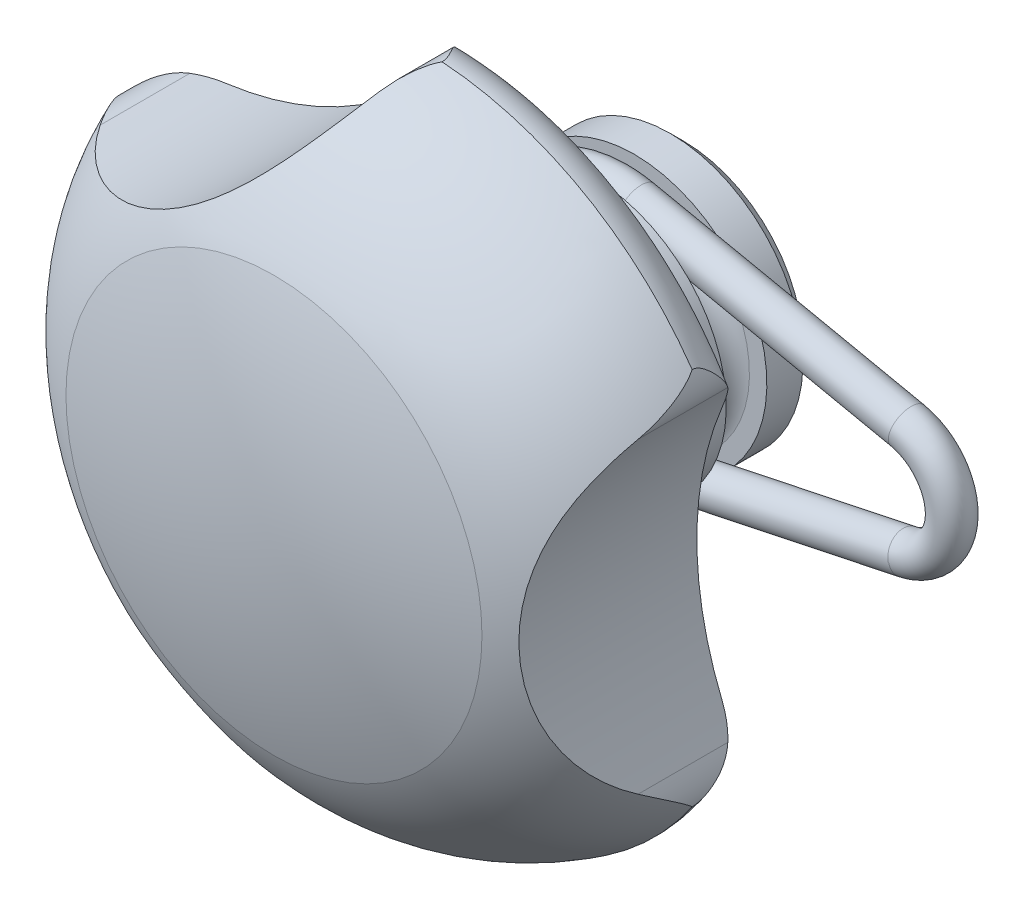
ISO-10303-21;
HEADER;
FILE_DESCRIPTION(('STEP AP214'),'2;1');
FILE_NAME('part.step','',(''),(''),'','','');
FILE_SCHEMA(('AUTOMOTIVE_DESIGN { 1 0 10303 214 1 1 1 1 }'));
ENDSEC;
DATA;
#1=APPLICATION_CONTEXT('core data for automotive mechanical design processes');
#2=APPLICATION_PROTOCOL_DEFINITION('international standard','automotive_design',2000,#1);
#3=PRODUCT_CONTEXT('',#1,'mechanical');
#4=PRODUCT('Part','Part','',(#3));
#5=PRODUCT_RELATED_PRODUCT_CATEGORY('part','',(#4));
#6=PRODUCT_DEFINITION_FORMATION('','',#4);
#7=PRODUCT_DEFINITION_CONTEXT('part definition',#1,'design');
#8=PRODUCT_DEFINITION('design','',#6,#7);
#9=PRODUCT_DEFINITION_SHAPE('','',#8);
#10=(LENGTH_UNIT() NAMED_UNIT(*) SI_UNIT(.MILLI.,.METRE.));
#11=(NAMED_UNIT(*) PLANE_ANGLE_UNIT() SI_UNIT($,.RADIAN.));
#12=(NAMED_UNIT(*) SI_UNIT($,.STERADIAN.) SOLID_ANGLE_UNIT());
#13=UNCERTAINTY_MEASURE_WITH_UNIT(LENGTH_MEASURE(1.E-05),#10,'distance_accuracy_value','');
#14=(GEOMETRIC_REPRESENTATION_CONTEXT(3) GLOBAL_UNCERTAINTY_ASSIGNED_CONTEXT((#13)) GLOBAL_UNIT_ASSIGNED_CONTEXT((#10,
#11,#12)) REPRESENTATION_CONTEXT('',''));
#15=CARTESIAN_POINT('',(0.,0.,0.));
#16=DIRECTION('',(0.,0.,1.));
#17=DIRECTION('',(1.,0.,0.));
#18=AXIS2_PLACEMENT_3D('',#15,#16,#17);
#19=CARTESIAN_POINT('',(0.,0.,4.5));
#20=DIRECTION('',(0.,0.,1.));
#21=DIRECTION('',(0.,1.,0.));
#22=AXIS2_PLACEMENT_3D('',#19,#20,#21);
#23=TOROIDAL_SURFACE('',#22,7.13958333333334,1.23958333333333);
#24=CARTESIAN_POINT('',(0.,0.,5.725));
#25=DIRECTION('',(0.,0.,1.));
#26=DIRECTION('',(0.,1.,0.));
#27=AXIS2_PLACEMENT_3D('',#24,#25,#26);
#28=CIRCLE('',#27,6.95);
#29=CARTESIAN_POINT('',(0.,6.95,5.725));
#30=VERTEX_POINT('',#29);
#31=EDGE_CURVE('E556',#30,#30,#28,.T.);
#32=ORIENTED_EDGE('',*,*,#31,.F.);
#33=EDGE_LOOP('',(#32));
#34=FACE_BOUND('',#33,.T.);
#35=CARTESIAN_POINT('',(0.,0.,3.44102201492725));
#36=DIRECTION('',(0.,0.,-1.));
#37=DIRECTION('',(0.,-1.,0.));
#38=AXIS2_PLACEMENT_3D('',#35,#36,#37);
#39=CIRCLE('',#38,6.49527559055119);
#40=CARTESIAN_POINT('',(1.33724531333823,-6.35612932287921,3.44102201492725));
#41=VERTEX_POINT('',#40);
#42=CARTESIAN_POINT('',(1.33724531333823,6.35612932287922,3.44102201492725));
#43=VERTEX_POINT('',#42);
#44=EDGE_CURVE('E360',#41,#43,#39,.T.);
#45=ORIENTED_EDGE('',*,*,#44,.T.);
#46=CARTESIAN_POINT('',(1.18360820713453,6.38375954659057,5.55731998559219));
#47=CARTESIAN_POINT('',(1.24773284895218,6.37410746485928,5.55864582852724));
#48=CARTESIAN_POINT('',(1.31155244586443,6.36218656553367,5.55919610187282));
#49=CARTESIAN_POINT('',(1.43853648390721,6.33359376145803,5.5585586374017));
#50=CARTESIAN_POINT('',(1.50169409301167,6.31689186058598,5.55735972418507));
#51=CARTESIAN_POINT('',(1.62853119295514,6.27801378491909,5.55294354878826));
#52=CARTESIAN_POINT('',(1.69215925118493,6.25567529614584,5.54966105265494));
#53=CARTESIAN_POINT('',(1.81669491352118,6.20514438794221,5.540172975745));
#54=CARTESIAN_POINT('',(1.8776099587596,6.17696935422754,5.53397600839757));
#55=CARTESIAN_POINT('',(1.97927447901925,6.12213326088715,5.51920197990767));
#56=CARTESIAN_POINT('',(2.02104429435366,6.09709973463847,5.5117119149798));
#57=CARTESIAN_POINT('',(2.10079792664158,6.04302302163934,5.49311944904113));
#58=CARTESIAN_POINT('',(2.13880068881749,6.01400185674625,5.48203646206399));
#59=CARTESIAN_POINT('',(2.21012027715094,5.95144641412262,5.45452305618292));
#60=CARTESIAN_POINT('',(2.24334383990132,5.91784226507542,5.43800276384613));
#61=CARTESIAN_POINT('',(2.30230739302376,5.84811941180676,5.39826438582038));
#62=CARTESIAN_POINT('',(2.32805957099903,5.81200492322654,5.37505733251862));
#63=CARTESIAN_POINT('',(2.36829473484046,5.74562176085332,5.32569514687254));
#64=CARTESIAN_POINT('',(2.38389114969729,5.71529230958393,5.30051135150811));
#65=CARTESIAN_POINT('',(2.41011711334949,5.65666078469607,5.24555949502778));
#66=CARTESIAN_POINT('',(2.42073873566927,5.62836200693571,5.21578421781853));
#67=CARTESIAN_POINT('',(2.43831778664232,5.57463928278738,5.15187931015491));
#68=CARTESIAN_POINT('',(2.44520882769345,5.5492733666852,5.11768341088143));
#69=CARTESIAN_POINT('',(2.45626004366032,5.50276699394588,5.04615575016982));
#70=CARTESIAN_POINT('',(2.46042016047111,5.48162662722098,5.00882392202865));
#71=CARTESIAN_POINT('',(2.46767355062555,5.43993676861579,4.92340519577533));
#72=CARTESIAN_POINT('',(2.47034247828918,5.42050059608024,4.87473660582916));
#73=CARTESIAN_POINT('',(2.47421114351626,5.38894314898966,4.77501638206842));
#74=CARTESIAN_POINT('',(2.47540983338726,5.3768270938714,4.72396307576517));
#75=CARTESIAN_POINT('',(2.47707480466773,5.35911407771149,4.61430661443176));
#76=CARTESIAN_POINT('',(2.4774339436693,5.3544922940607,4.55554200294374));
#77=CARTESIAN_POINT('',(2.47740387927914,5.35483911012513,4.43802486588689));
#78=CARTESIAN_POINT('',(2.47701436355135,5.3598117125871,4.37927235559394));
#79=CARTESIAN_POINT('',(2.47514837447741,5.37954611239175,4.26161965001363));
#80=CARTESIAN_POINT('',(2.4736395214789,5.39459819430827,4.20276828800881));
#81=CARTESIAN_POINT('',(2.46842995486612,5.43444041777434,4.08854356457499));
#82=CARTESIAN_POINT('',(2.4647301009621,5.45922673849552,4.03316884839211));
#83=CARTESIAN_POINT('',(2.45422520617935,5.5120686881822,3.93798589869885));
#84=CARTESIAN_POINT('',(2.44815567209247,5.53857463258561,3.8972339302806));
#85=CARTESIAN_POINT('',(2.43164748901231,5.59652396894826,3.82039902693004));
#86=CARTESIAN_POINT('',(2.42121574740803,5.62795950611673,3.78430882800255));
#87=CARTESIAN_POINT('',(2.39624962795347,5.68895859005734,3.72314541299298));
#88=CARTESIAN_POINT('',(2.38261483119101,5.71804298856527,3.69723204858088));
#89=CARTESIAN_POINT('',(2.350071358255,5.7770209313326,3.6501039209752));
#90=CARTESIAN_POINT('',(2.33116982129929,5.80691333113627,3.62888286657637));
#91=CARTESIAN_POINT('',(2.28801420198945,5.86577816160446,3.59120197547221));
#92=CARTESIAN_POINT('',(2.26376245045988,5.89475098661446,3.57474007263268));
#93=CARTESIAN_POINT('',(2.21065854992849,5.95047151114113,3.54603516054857));
#94=CARTESIAN_POINT('',(2.18180164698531,5.9772168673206,3.53379655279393));
#95=CARTESIAN_POINT('',(2.10456351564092,6.04114197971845,3.50712071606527));
#96=CARTESIAN_POINT('',(2.05388195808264,6.07643423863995,3.49489877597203));
#97=CARTESIAN_POINT('',(1.94748138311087,6.14073512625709,3.4752901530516));
#98=CARTESIAN_POINT('',(1.89172532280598,6.16969124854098,3.467942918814));
#99=CARTESIAN_POINT('',(1.78248976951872,6.21970258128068,3.45688384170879));
#100=CARTESIAN_POINT('',(1.72924801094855,6.24123114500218,3.4529070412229));
#101=CARTESIAN_POINT('',(1.62115664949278,6.28026611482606,3.44678229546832));
#102=CARTESIAN_POINT('',(1.56630518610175,6.29776764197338,3.44463656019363));
#103=CARTESIAN_POINT('',(1.45712297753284,6.3286230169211,3.44181796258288));
#104=CARTESIAN_POINT('',(1.40282260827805,6.34208165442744,3.44110452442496));
#105=CARTESIAN_POINT('',(1.29362893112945,6.36550845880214,3.44095642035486));
#106=CARTESIAN_POINT('',(1.23873768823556,6.37548621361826,3.44151820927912));
#107=CARTESIAN_POINT('',(1.18360820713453,6.38375954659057,3.44268001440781));
#108=B_SPLINE_CURVE_WITH_KNOTS('',3,(#46,#47,#48,#49,#50,#51,#52,#53,#54,#55,#56,#57,#58,#59,
#60,#61,#62,#63,#64,#65,#66,#67,#68,#69,#70,#71,#72,#73,#74,#75,#76,#77,#78,#79,#80,#81,#82,#83,
#84,#85,#86,#87,#88,#89,#90,#91,#92,#93,#94,#95,#96,#97,#98,#99,#100,#101,#102,#103,#104,#105,
#106,#107),.UNSPECIFIED.,.F.,.F.,(4,2,2,2,2,2,2,2,2,2,2,2,2,2,2,2,2,2,2,2,2,2,2,2,2,2,2,2,2,2,
4),(0.,0.194565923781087,0.390380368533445,0.592650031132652,0.794325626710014,0.94180936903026,
1.08850912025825,1.23776687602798,1.38677977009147,1.5133361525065,1.6400935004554,
1.76903803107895,1.89798530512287,2.05477677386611,2.21167990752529,2.3877171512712,
2.56382785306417,2.74524199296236,2.92658499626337,3.07299322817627,3.2191705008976,
3.34243093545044,3.46552509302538,3.58856573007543,3.71173421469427,3.89952333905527,
4.08881419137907,4.26129024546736,4.43397417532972,4.60169289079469,4.76894591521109),.UNSPECIFIED.);
#109=CARTESIAN_POINT('',(1.33724531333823,6.35612932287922,5.55897798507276));
#110=VERTEX_POINT('',#109);
#111=EDGE_CURVE('E198',#110,#43,#108,.T.);
#112=ORIENTED_EDGE('',*,*,#111,.F.);
#113=CARTESIAN_POINT('',(0.,0.,5.55897798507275));
#114=DIRECTION('',(0.,0.,1.));
#115=DIRECTION('',(0.,1.,0.));
#116=AXIS2_PLACEMENT_3D('',#113,#114,#115);
#117=CIRCLE('',#116,6.49527559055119);
#118=CARTESIAN_POINT('',(1.33724531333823,-6.35612932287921,5.55897798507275));
#119=VERTEX_POINT('',#118);
#120=EDGE_CURVE('E133',#110,#119,#117,.T.);
#121=ORIENTED_EDGE('',*,*,#120,.T.);
#122=CARTESIAN_POINT('',(1.18360820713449,-6.38375954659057,3.44268001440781));
#123=CARTESIAN_POINT('',(1.24773284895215,-6.37410746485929,3.44135417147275));
#124=CARTESIAN_POINT('',(1.31155244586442,-6.36218656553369,3.44080389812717));
#125=CARTESIAN_POINT('',(1.4385364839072,-6.33359376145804,3.44144136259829));
#126=CARTESIAN_POINT('',(1.50169409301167,-6.31689186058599,3.44264027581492));
#127=CARTESIAN_POINT('',(1.62853119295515,-6.2780137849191,3.44705645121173));
#128=CARTESIAN_POINT('',(1.69215925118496,-6.25567529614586,3.45033894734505));
#129=CARTESIAN_POINT('',(1.81669491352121,-6.20514438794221,3.459827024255));
#130=CARTESIAN_POINT('',(1.87760995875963,-6.17696935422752,3.46602399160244));
#131=CARTESIAN_POINT('',(1.97927447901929,-6.12213326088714,3.48079802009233));
#132=CARTESIAN_POINT('',(2.02104429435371,-6.09709973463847,3.4882880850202));
#133=CARTESIAN_POINT('',(2.10079792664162,-6.04302302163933,3.50688055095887));
#134=CARTESIAN_POINT('',(2.13880068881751,-6.01400185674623,3.51796353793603));
#135=CARTESIAN_POINT('',(2.21012027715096,-5.9514464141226,3.54547694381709));
#136=CARTESIAN_POINT('',(2.24334383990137,-5.91784226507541,3.56199723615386));
#137=CARTESIAN_POINT('',(2.3023073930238,-5.84811941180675,3.60173561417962));
#138=CARTESIAN_POINT('',(2.32805957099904,-5.81200492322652,3.62494266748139));
#139=CARTESIAN_POINT('',(2.36829473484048,-5.7456217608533,3.67430485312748));
#140=CARTESIAN_POINT('',(2.38389114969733,-5.71529230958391,3.69948864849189));
#141=CARTESIAN_POINT('',(2.41011711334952,-5.65666078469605,3.75444050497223));
#142=CARTESIAN_POINT('',(2.42073873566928,-5.62836200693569,3.78421578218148));
#143=CARTESIAN_POINT('',(2.43831778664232,-5.57463928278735,3.84812068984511));
#144=CARTESIAN_POINT('',(2.44520882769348,-5.54927336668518,3.88231658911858));
#145=CARTESIAN_POINT('',(2.45626004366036,-5.50276699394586,3.9538442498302));
#146=CARTESIAN_POINT('',(2.46042016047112,-5.48162662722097,3.99117607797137));
#147=CARTESIAN_POINT('',(2.46767355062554,-5.43993676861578,4.0765948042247));
#148=CARTESIAN_POINT('',(2.47034247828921,-5.42050059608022,4.12526339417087));
#149=CARTESIAN_POINT('',(2.47421114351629,-5.38894314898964,4.2249836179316));
#150=CARTESIAN_POINT('',(2.47540983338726,-5.37682709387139,4.27603692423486));
#151=CARTESIAN_POINT('',(2.47707480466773,-5.3591140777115,4.38569338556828));
#152=CARTESIAN_POINT('',(2.47743394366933,-5.35449229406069,4.4444579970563));
#153=CARTESIAN_POINT('',(2.47740387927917,-5.35483911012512,4.56197513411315));
#154=CARTESIAN_POINT('',(2.47701436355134,-5.35981171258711,4.6207276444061));
#155=CARTESIAN_POINT('',(2.47514837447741,-5.37954611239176,4.7383803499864));
#156=CARTESIAN_POINT('',(2.47363952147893,-5.39459819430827,4.79723171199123));
#157=CARTESIAN_POINT('',(2.46842995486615,-5.43444041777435,4.91145643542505));
#158=CARTESIAN_POINT('',(2.46473010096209,-5.45922673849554,4.96683115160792));
#159=CARTESIAN_POINT('',(2.45422520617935,-5.51206868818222,5.06201410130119));
#160=CARTESIAN_POINT('',(2.4481556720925,-5.53857463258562,5.10276606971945));
#161=CARTESIAN_POINT('',(2.43164748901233,-5.59652396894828,5.17960097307));
#162=CARTESIAN_POINT('',(2.42121574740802,-5.62795950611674,5.21569117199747));
#163=CARTESIAN_POINT('',(2.39624962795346,-5.68895859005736,5.27685458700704));
#164=CARTESIAN_POINT('',(2.38261483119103,-5.71804298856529,5.30276795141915));
#165=CARTESIAN_POINT('',(2.35007135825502,-5.77702093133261,5.34989607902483));
#166=CARTESIAN_POINT('',(2.33116982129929,-5.80691333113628,5.37111713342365));
#167=CARTESIAN_POINT('',(2.28801420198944,-5.86577816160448,5.40879802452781));
#168=CARTESIAN_POINT('',(2.26376245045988,-5.89475098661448,5.42525992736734));
#169=CARTESIAN_POINT('',(2.21065854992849,-5.95047151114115,5.45396483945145));
#170=CARTESIAN_POINT('',(2.1818016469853,-5.97721686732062,5.46620344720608));
#171=CARTESIAN_POINT('',(2.10456351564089,-6.04114197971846,5.49287928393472));
#172=CARTESIAN_POINT('',(2.05388195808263,-6.07643423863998,5.50510122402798));
#173=CARTESIAN_POINT('',(1.94748138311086,-6.14073512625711,5.52470984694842));
#174=CARTESIAN_POINT('',(1.89172532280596,-6.16969124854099,5.532057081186));
#175=CARTESIAN_POINT('',(1.7824897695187,-6.21970258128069,5.54311615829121));
#176=CARTESIAN_POINT('',(1.72924801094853,-6.24123114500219,5.54709295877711));
#177=CARTESIAN_POINT('',(1.62115664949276,-6.28026611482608,5.55321770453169));
#178=CARTESIAN_POINT('',(1.56630518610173,-6.2977676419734,5.55536343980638));
#179=CARTESIAN_POINT('',(1.45712297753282,-6.32862301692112,5.55818203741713));
#180=CARTESIAN_POINT('',(1.40282260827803,-6.34208165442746,5.55889547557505));
#181=CARTESIAN_POINT('',(1.29362893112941,-6.36550845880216,5.55904357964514));
#182=CARTESIAN_POINT('',(1.23873768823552,-6.37548621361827,5.55848179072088));
#183=CARTESIAN_POINT('',(1.18360820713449,-6.38375954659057,5.55731998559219));
#184=B_SPLINE_CURVE_WITH_KNOTS('',3,(#122,#123,#124,#125,#126,#127,#128,#129,#130,#131,#132,
#133,#134,#135,#136,#137,#138,#139,#140,#141,#142,#143,#144,#145,#146,#147,#148,#149,#150,#151,
#152,#153,#154,#155,#156,#157,#158,#159,#160,#161,#162,#163,#164,#165,#166,#167,#168,#169,#170,
#171,#172,#173,#174,#175,#176,#177,#178,#179,#180,#181,#182,#183),.UNSPECIFIED.,.F.,.F.,(4,2,2,
2,2,2,2,2,2,2,2,2,2,2,2,2,2,2,2,2,2,2,2,2,2,2,2,2,2,2,4),(0.,0.194565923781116,
0.390380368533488,0.592650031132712,0.794325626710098,0.941809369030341,1.08850912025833,
1.23776687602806,1.38677977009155,1.51333615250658,1.64009350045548,1.76903803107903,
1.89798530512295,2.0547767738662,2.21167990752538,2.3877171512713,2.56382785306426,
2.74524199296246,2.92658499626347,3.07299322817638,3.2191705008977,3.34243093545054,
3.46552509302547,3.58856573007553,3.71173421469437,3.89952333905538,4.08881419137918,
4.26129024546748,4.43397417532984,4.6016928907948,4.76894591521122),.UNSPECIFIED.);
#185=EDGE_CURVE('E129',#41,#119,#184,.T.);
#186=ORIENTED_EDGE('',*,*,#185,.F.);
#187=EDGE_LOOP('',(#45,#112,#121,#186));
#188=FACE_BOUND('',#187,.T.);
#189=CARTESIAN_POINT('',(0.,0.,3.275));
#190=DIRECTION('',(0.,0.,1.));
#191=DIRECTION('',(0.,1.,0.));
#192=AXIS2_PLACEMENT_3D('',#189,#190,#191);
#193=CIRCLE('',#192,6.95);
#194=CARTESIAN_POINT('',(0.,6.95,3.275));
#195=VERTEX_POINT('',#194);
#196=EDGE_CURVE('E553',#195,#195,#193,.T.);
#197=ORIENTED_EDGE('',*,*,#196,.T.);
#198=EDGE_LOOP('',(#197));
#199=FACE_BOUND('',#198,.T.);
#200=ADVANCED_FACE('F14',(#34,#188,#199),#23,.F.);
#201=CARTESIAN_POINT('',(0.,0.,16.2));
#202=DIRECTION('',(0.,0.,1.));
#203=DIRECTION('',(0.,1.,0.));
#204=AXIS2_PLACEMENT_3D('',#201,#202,#203);
#205=TOROIDAL_SURFACE('',#204,17.3,2.7);
#206=CARTESIAN_POINT('',(0.,0.,13.5));
#207=DIRECTION('',(0.,0.,1.));
#208=DIRECTION('',(0.,1.,0.));
#209=AXIS2_PLACEMENT_3D('',#206,#207,#208);
#210=CIRCLE('',#209,17.3);
#211=CARTESIAN_POINT('',(15.5189705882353,7.64536146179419,13.5));
#212=VERTEX_POINT('',#211);
#213=CARTESIAN_POINT('',(-1.13840804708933,17.2625035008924,13.5));
#214=VERTEX_POINT('',#213);
#215=EDGE_CURVE('E440',#212,#214,#210,.T.);
#216=ORIENTED_EDGE('',*,*,#215,.T.);
#217=CARTESIAN_POINT('',(-4.38339926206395,13.9264428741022,16.2002));
#218=CARTESIAN_POINT('',(-4.38341893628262,13.9264277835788,16.1669115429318));
#219=CARTESIAN_POINT('',(-4.38211329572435,13.9274883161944,16.133646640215));
#220=CARTESIAN_POINT('',(-4.37698536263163,13.9316590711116,16.0675030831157));
#221=CARTESIAN_POINT('',(-4.37316789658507,13.9347653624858,16.0346238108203));
#222=CARTESIAN_POINT('',(-4.3583121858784,13.946867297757,15.9379988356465));
#223=CARTESIAN_POINT('',(-4.34386090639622,13.9586534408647,15.8751061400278));
#224=CARTESIAN_POINT('',(-4.30148582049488,13.9933687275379,15.7321649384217));
#225=CARTESIAN_POINT('',(-4.27064204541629,14.0187324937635,15.6536244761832));
#226=CARTESIAN_POINT('',(-4.2001823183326,14.0771450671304,15.5031042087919));
#227=CARTESIAN_POINT('',(-4.16049704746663,14.110254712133,15.4311829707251));
#228=CARTESIAN_POINT('',(-4.07646733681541,14.1810087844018,15.2949888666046));
#229=CARTESIAN_POINT('',(-4.03223289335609,14.218548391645,15.2305910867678));
#230=CARTESIAN_POINT('',(-3.94020936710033,14.2974035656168,15.1067938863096));
#231=CARTESIAN_POINT('',(-3.89241679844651,14.3387228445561,15.047399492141));
#232=CARTESIAN_POINT('',(-3.79437821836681,14.4243512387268,14.9328564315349));
#233=CARTESIAN_POINT('',(-3.74412990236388,14.4686631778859,14.8777118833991));
#234=CARTESIAN_POINT('',(-3.64191298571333,14.5597634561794,14.7711711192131));
#235=CARTESIAN_POINT('',(-3.58994376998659,14.6065526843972,14.7197762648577));
#236=CARTESIAN_POINT('',(-3.42981666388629,14.7523071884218,14.5683622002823));
#237=CARTESIAN_POINT('',(-3.31970596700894,14.8546903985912,14.47366921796));
#238=CARTESIAN_POINT('',(-3.09676862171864,15.0669662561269,14.2965582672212));
#239=CARTESIAN_POINT('',(-2.98393959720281,15.176865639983,14.2141515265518));
#240=CARTESIAN_POINT('',(-2.75693985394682,15.403462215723,14.0613463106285));
#241=CARTESIAN_POINT('',(-2.6427689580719,15.5201603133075,13.9909494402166));
#242=CARTESIAN_POINT('',(-2.41407314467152,15.7599019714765,13.8626621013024));
#243=CARTESIAN_POINT('',(-2.29954828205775,15.8829445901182,13.8047697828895));
#244=CARTESIAN_POINT('',(-2.09176384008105,16.1120518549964,13.7118745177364));
#245=CARTESIAN_POINT('',(-1.99842485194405,16.2171344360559,13.6746235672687));
#246=CARTESIAN_POINT('',(-1.81251251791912,16.4310134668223,13.6100598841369));
#247=CARTESIAN_POINT('',(-1.7199392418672,16.5398102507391,13.5827480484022));
#248=CARTESIAN_POINT('',(-1.53625868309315,16.760492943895,13.5391459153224));
#249=CARTESIAN_POINT('',(-1.44514902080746,16.8723728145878,13.5228354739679));
#250=CARTESIAN_POINT('',(-1.26485811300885,17.098760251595,13.5023513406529));
#251=CARTESIAN_POINT('',(-1.17567673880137,17.2132676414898,13.4981768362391));
#252=CARTESIAN_POINT('',(-0.960144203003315,17.4963376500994,13.5044394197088));
#253=CARTESIAN_POINT('',(-0.83522153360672,17.6659285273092,13.5223376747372));
#254=CARTESIAN_POINT('',(-0.59404749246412,18.0042493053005,13.5906370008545));
#255=CARTESIAN_POINT('',(-0.477770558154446,18.1729802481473,13.6409376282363));
#256=CARTESIAN_POINT('',(-0.284058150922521,18.4630666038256,13.7606491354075));
#257=CARTESIAN_POINT('',(-0.204093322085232,18.5858867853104,13.822341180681));
#258=CARTESIAN_POINT('',(-0.0902066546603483,18.7647911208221,13.9309140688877));
#259=CARTESIAN_POINT('',(-0.0531469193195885,18.8237162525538,13.9699267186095));
#260=CARTESIAN_POINT('',(0.0186848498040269,18.9391980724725,14.0533309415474));
#261=CARTESIAN_POINT('',(0.0534548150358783,18.9957526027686,14.0977272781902));
#262=CARTESIAN_POINT('',(0.0869666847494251,19.0508476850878,14.1448023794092));
#263=B_SPLINE_CURVE_WITH_KNOTS('',3,(#217,#218,#219,#220,#221,#222,#223,#224,#225,#226,#227,
#228,#229,#230,#231,#232,#233,#234,#235,#236,#237,#238,#239,#240,#241,#242,#243,#244,#245,#246,
#247,#248,#249,#250,#251,#252,#253,#254,#255,#256,#257,#258,#259,#260,#261,#262),.UNSPECIFIED.,
.F.,.F.,(4,2,2,2,2,2,2,2,2,2,2,2,2,2,2,2,2,2,2,2,2,2,4),(0.,0.0997804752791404,
0.199369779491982,0.395127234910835,0.657978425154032,0.922967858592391,1.18261771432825,
1.44252538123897,1.70268182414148,1.96293227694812,2.49520736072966,3.02796591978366,
3.56079561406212,4.09354642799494,4.52940574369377,4.9653043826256,5.40040269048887,
5.83547186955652,6.46728364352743,7.09714623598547,7.57244031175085,7.81160655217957,
8.05098596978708),.UNSPECIFIED.);
#264=CARTESIAN_POINT('',(0.0868450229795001,19.0506476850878,14.1446315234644));
#265=VERTEX_POINT('',#264);
#266=EDGE_CURVE('E310',#214,#265,#263,.T.);
#267=ORIENTED_EDGE('',*,*,#266,.T.);
#268=CARTESIAN_POINT('',(1.32816042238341,19.9558510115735,16.2002));
#269=CARTESIAN_POINT('',(1.32821754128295,19.9558555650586,16.1686312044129));
#270=CARTESIAN_POINT('',(1.3263676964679,19.9554203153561,16.1371106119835));
#271=CARTESIAN_POINT('',(1.31927710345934,19.9537003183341,16.0746102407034));
#272=CARTESIAN_POINT('',(1.31405128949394,19.9524193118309,16.0436286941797));
#273=CARTESIAN_POINT('',(1.2941982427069,19.9474186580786,15.9530438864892));
#274=CARTESIAN_POINT('',(1.27536012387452,19.9425384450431,15.8944350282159));
#275=CARTESIAN_POINT('',(1.23358140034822,19.9307619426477,15.7882994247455));
#276=CARTESIAN_POINT('',(1.21154177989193,19.9242281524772,15.740346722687));
#277=CARTESIAN_POINT('',(1.16407883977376,19.9090912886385,15.6464597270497));
#278=CARTESIAN_POINT('',(1.13865297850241,19.9004866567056,15.6005269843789));
#279=CARTESIAN_POINT('',(1.08533313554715,19.8811026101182,15.5096896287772));
#280=CARTESIAN_POINT('',(1.05740867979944,19.8702934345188,15.4648096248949));
#281=CARTESIAN_POINT('',(1.00026280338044,19.8465764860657,15.3764449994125));
#282=CARTESIAN_POINT('',(0.971041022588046,19.8336681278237,15.3329607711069));
#283=CARTESIAN_POINT('',(0.885824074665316,19.7934186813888,15.2093395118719));
#284=CARTESIAN_POINT('',(0.828934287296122,19.7633853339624,15.1306814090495));
#285=CARTESIAN_POINT('',(0.715102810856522,19.6955914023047,14.9767275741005));
#286=CARTESIAN_POINT('',(0.658161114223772,19.6578251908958,14.9014343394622));
#287=CARTESIAN_POINT('',(0.546302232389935,19.5746365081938,14.7547181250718));
#288=CARTESIAN_POINT('',(0.491372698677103,19.5292762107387,14.6832694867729));
#289=CARTESIAN_POINT('',(0.38448260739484,19.4304652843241,14.5439203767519));
#290=CARTESIAN_POINT('',(0.332519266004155,19.3770224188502,14.4760165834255));
#291=CARTESIAN_POINT('',(0.247602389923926,19.2788232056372,14.3637184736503));
#292=CARTESIAN_POINT('',(0.213567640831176,19.2361641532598,14.3183046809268));
#293=CARTESIAN_POINT('',(0.148061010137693,19.1465378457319,14.2296471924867));
#294=CARTESIAN_POINT('',(0.116596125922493,19.0995595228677,14.1864095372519));
#295=CARTESIAN_POINT('',(0.0867233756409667,19.0504476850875,14.1444607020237));
#296=B_SPLINE_CURVE_WITH_KNOTS('',3,(#268,#269,#270,#271,#272,#273,#274,#275,#276,#277,#278,
#279,#280,#281,#282,#283,#284,#285,#286,#287,#288,#289,#290,#291,#292,#293,#294,#295),
.UNSPECIFIED.,.F.,.F.,(4,2,2,2,2,2,2,2,2,2,2,2,2,4),(0.,0.0945684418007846,0.188721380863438,
0.373012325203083,0.532347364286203,0.691802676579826,0.853573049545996,1.01538861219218,
1.31984172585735,1.62451718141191,1.92681035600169,2.22881499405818,2.44161001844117,
2.65496637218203),.UNSPECIFIED.);
#297=CARTESIAN_POINT('',(1.3281604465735,19.9558510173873,16.2));
#298=VERTEX_POINT('',#297);
#299=EDGE_CURVE('E302',#298,#265,#296,.T.);
#300=ORIENTED_EDGE('',*,*,#299,.F.);
#301=CARTESIAN_POINT('',(0.,0.,16.2));
#302=DIRECTION('',(0.,0.,1.));
#303=DIRECTION('',(0.,1.,0.));
#304=AXIS2_PLACEMENT_3D('',#301,#302,#303);
#305=CIRCLE('',#304,20.);
#306=CARTESIAN_POINT('',(16.4180808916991,11.4213230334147,16.2000000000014));
#307=VERTEX_POINT('',#306);
#308=EDGE_CURVE('E446',#307,#298,#305,.T.);
#309=ORIENTED_EDGE('',*,*,#308,.F.);
#310=CARTESIAN_POINT('',(16.2770691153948,9.26810235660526,13.9102452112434));
#311=CARTESIAN_POINT('',(16.3154932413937,9.34156985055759,13.9538365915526));
#312=CARTESIAN_POINT('',(16.3498543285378,9.41559311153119,13.9998978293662));
#313=CARTESIAN_POINT('',(16.4108533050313,9.56391180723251,14.0962349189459));
#314=CARTESIAN_POINT('',(16.4375029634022,9.63820665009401,14.1465041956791));
#315=CARTESIAN_POINT('',(16.4834941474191,9.78612792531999,14.2504373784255));
#316=CARTESIAN_POINT('',(16.5028677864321,9.85975586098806,14.304085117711));
#317=CARTESIAN_POINT('',(16.5349607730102,10.0060983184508,14.4145287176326));
#318=CARTESIAN_POINT('',(16.547677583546,10.0788124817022,14.4713257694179));
#319=CARTESIAN_POINT('',(16.5764036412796,10.293885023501,14.6451502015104));
#320=CARTESIAN_POINT('',(16.5832967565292,10.4342227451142,14.766348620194));
#321=CARTESIAN_POINT('',(16.5783481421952,10.6369259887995,14.955697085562));
#322=CARTESIAN_POINT('',(16.574147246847,10.703210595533,15.0200907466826));
#323=CARTESIAN_POINT('',(16.5612980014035,10.8324200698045,15.1517455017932));
#324=CARTESIAN_POINT('',(16.5526513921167,10.8953462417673,15.2190054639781));
#325=CARTESIAN_POINT('',(16.5329071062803,11.0101918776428,15.3498468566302));
#326=CARTESIAN_POINT('',(16.5221608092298,11.0625739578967,15.4130761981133));
#327=CARTESIAN_POINT('',(16.4988591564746,11.1620042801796,15.5435064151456));
#328=CARTESIAN_POINT('',(16.486302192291,11.2090477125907,15.6107107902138));
#329=CARTESIAN_POINT('',(16.4655393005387,11.280171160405,15.7279244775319));
#330=CARTESIAN_POINT('',(16.4572508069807,11.3067349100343,15.7763876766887));
#331=CARTESIAN_POINT('',(16.4420387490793,11.353418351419,15.8762959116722));
#332=CARTESIAN_POINT('',(16.4351063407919,11.3735803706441,15.9277185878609));
#333=CARTESIAN_POINT('',(16.4261043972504,11.3991886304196,16.0160405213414));
#334=CARTESIAN_POINT('',(16.4231839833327,11.4073009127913,16.0520514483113));
#335=CARTESIAN_POINT('',(16.419131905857,11.4184571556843,16.125383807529));
#336=CARTESIAN_POINT('',(16.4180228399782,11.4214371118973,16.1627159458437));
#337=CARTESIAN_POINT('',(16.4180809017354,11.4213230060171,16.2002));
#338=B_SPLINE_CURVE_WITH_KNOTS('',3,(#310,#311,#312,#313,#314,#315,#316,#317,#318,#319,#320,
#321,#322,#323,#324,#325,#326,#327,#328,#329,#330,#331,#332,#333,#334,#335,#336,#337),
.UNSPECIFIED.,.F.,.F.,(4,2,2,2,2,2,2,2,2,2,2,2,2,4),(0.,0.280769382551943,0.561107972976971,
0.840194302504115,1.11938691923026,1.6738537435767,1.95124208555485,2.22852189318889,
2.47677259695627,2.72524520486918,2.8926272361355,3.05887832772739,3.1695793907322,
3.28165125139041),.UNSPECIFIED.);
#339=CARTESIAN_POINT('',(16.2771737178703,9.26830235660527,13.9103638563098));
#340=VERTEX_POINT('',#339);
#341=EDGE_CURVE('E294',#340,#307,#338,.T.);
#342=ORIENTED_EDGE('',*,*,#341,.F.);
#343=CARTESIAN_POINT('',(16.2772783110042,9.26850235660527,13.9104825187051));
#344=CARTESIAN_POINT('',(16.2294572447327,9.17709415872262,13.8562183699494));
#345=CARTESIAN_POINT('',(16.1810129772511,9.08270871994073,13.8077413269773));
#346=CARTESIAN_POINT('',(16.0837982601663,8.88938867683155,13.7220284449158));
#347=CARTESIAN_POINT('',(16.0350286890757,8.79046385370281,13.684769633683));
#348=CARTESIAN_POINT('',(15.9385341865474,8.5904402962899,13.6213700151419));
#349=CARTESIAN_POINT('',(15.890804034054,8.48938881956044,13.5950861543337));
#350=CARTESIAN_POINT('',(15.796277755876,8.28475709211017,13.5523146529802));
#351=CARTESIAN_POINT('',(15.7494821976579,8.18117538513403,13.5358327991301));
#352=CARTESIAN_POINT('',(15.6497456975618,7.95523777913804,13.510090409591));
#353=CARTESIAN_POINT('',(15.5970546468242,7.83258739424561,13.5024562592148));
#354=CARTESIAN_POINT('',(15.4940799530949,7.58609137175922,13.4985527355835));
#355=CARTESIAN_POINT('',(15.4437971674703,7.46224532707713,13.5022873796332));
#356=CARTESIAN_POINT('',(15.3456778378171,7.21347715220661,13.5201552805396));
#357=CARTESIAN_POINT('',(15.2978581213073,7.08855307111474,13.5343519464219));
#358=CARTESIAN_POINT('',(15.2052062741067,6.8391107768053,13.5722495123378));
#359=CARTESIAN_POINT('',(15.1603732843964,6.71459245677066,13.595947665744));
#360=CARTESIAN_POINT('',(15.0581745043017,6.42177291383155,13.6620983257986));
#361=CARTESIAN_POINT('',(15.0021062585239,6.25384509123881,13.7082310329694));
#362=CARTESIAN_POINT('',(14.8956575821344,5.92070211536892,13.8148228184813));
#363=CARTESIAN_POINT('',(14.8452802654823,5.75548848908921,13.8752896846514));
#364=CARTESIAN_POINT('',(14.7502919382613,5.42931932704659,14.009202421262));
#365=CARTESIAN_POINT('',(14.7056646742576,5.2683528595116,14.0826102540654));
#366=CARTESIAN_POINT('',(14.6219111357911,4.95141266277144,14.2420197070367));
#367=CARTESIAN_POINT('',(14.5827810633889,4.79543554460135,14.3280125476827));
#368=CARTESIAN_POINT('',(14.5181243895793,4.52452568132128,14.4923187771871));
#369=CARTESIAN_POINT('',(14.4915179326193,4.40825404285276,14.5680069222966));
#370=CARTESIAN_POINT('',(14.4415431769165,4.18094182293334,14.7282922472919));
#371=CARTESIAN_POINT('',(14.4181790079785,4.06990802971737,14.8129005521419));
#372=CARTESIAN_POINT('',(14.3856501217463,3.90900618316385,14.9481212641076));
#373=CARTESIAN_POINT('',(14.3751859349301,3.85609145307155,14.9948056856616));
#374=CARTESIAN_POINT('',(14.3551995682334,3.75294115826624,15.0912214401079));
#375=CARTESIAN_POINT('',(14.3456770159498,3.70270453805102,15.1409515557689));
#376=CARTESIAN_POINT('',(14.3276705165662,3.60581143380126,15.243828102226));
#377=CARTESIAN_POINT('',(14.31918481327,3.55914894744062,15.2969685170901));
#378=CARTESIAN_POINT('',(14.3033791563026,3.47061148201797,15.4072191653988));
#379=CARTESIAN_POINT('',(14.296057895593,3.42873115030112,15.4643248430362));
#380=CARTESIAN_POINT('',(14.2828834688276,3.35213430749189,15.5822097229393));
#381=CARTESIAN_POINT('',(14.2770106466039,3.31732316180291,15.6429240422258));
#382=CARTESIAN_POINT('',(14.2669315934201,3.25683123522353,15.768663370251));
#383=CARTESIAN_POINT('',(14.2627172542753,3.23110609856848,15.8336655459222));
#384=CARTESIAN_POINT('',(14.2571934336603,3.19715700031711,15.9488502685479));
#385=CARTESIAN_POINT('',(14.2554026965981,3.18605923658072,15.998151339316));
#386=CARTESIAN_POINT('',(14.2529696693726,3.17093266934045,16.0983206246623));
#387=CARTESIAN_POINT('',(14.2523385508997,3.16697263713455,16.1491993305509));
#388=CARTESIAN_POINT('',(14.2523529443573,3.16708632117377,16.2002));
#389=B_SPLINE_CURVE_WITH_KNOTS('',3,(#343,#344,#345,#346,#347,#348,#349,#350,#351,#352,#353,
#354,#355,#356,#357,#358,#359,#360,#361,#362,#363,#364,#365,#366,#367,#368,#369,#370,#371,#372,
#373,#374,#375,#376,#377,#378,#379,#380,#381,#382,#383,#384,#385,#386,#387,#388),.UNSPECIFIED.,
.F.,.F.,(4,2,2,2,2,2,2,2,2,2,2,2,2,2,2,2,2,2,2,2,2,2,4),(0.,0.349357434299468,0.697994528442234,
1.04193361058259,1.38607553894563,1.78662384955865,2.18731371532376,2.59045229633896,
2.99347442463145,3.54156405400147,4.08995214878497,4.63675444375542,5.18317708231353,
5.60665933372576,6.03067613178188,6.24459345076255,6.45842582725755,6.67189084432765,
6.8851145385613,7.09526208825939,7.30436908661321,7.45556369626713,7.60820741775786),.UNSPECIFIED.);
#390=EDGE_CURVE('E287',#340,#212,#389,.T.);
#391=ORIENTED_EDGE('',*,*,#390,.T.);
#392=EDGE_LOOP('',(#216,#267,#300,#309,#342,#391));
#393=FACE_BOUND('',#392,.T.);
#394=ADVANCED_FACE('F191',(#393),#205,.T.);
#395=CARTESIAN_POINT('',(-0.112128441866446,-18.7303971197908,13.9102393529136));
#396=CARTESIAN_POINT('',(-0.0677161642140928,-18.8004071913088,13.9538303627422));
#397=CARTESIAN_POINT('',(-0.020791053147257,-18.8671764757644,13.9998912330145));
#398=CARTESIAN_POINT('',(0.0771564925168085,-18.9941626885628,14.0962275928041));
#399=CARTESIAN_POINT('',(0.128172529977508,-19.0543895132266,14.1464965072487));
#400=CARTESIAN_POINT('',(0.233279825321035,-19.1681799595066,14.2504289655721));
#401=CARTESIAN_POINT('',(0.287356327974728,-19.2217721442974,14.3040763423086));
#402=CARTESIAN_POINT('',(0.398045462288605,-19.3227370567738,14.414519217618));
#403=CARTESIAN_POINT('',(0.454659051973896,-19.3701074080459,14.4713159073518));
#404=CARTESIAN_POINT('',(0.626553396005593,-19.5025217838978,14.64513925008));
#405=CARTESIAN_POINT('',(0.744642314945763,-19.5786607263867,14.7663369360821));
#406=CARTESIAN_POINT('',(0.922662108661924,-19.6757275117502,14.9556842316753));
#407=CARTESIAN_POINT('',(0.98216651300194,-19.7052320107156,15.0200774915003));
#408=CARTESIAN_POINT('',(1.1004895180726,-19.7587095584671,15.1517313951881));
#409=CARTESIAN_POINT('',(1.15930837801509,-19.7826847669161,15.2189909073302));
#410=CARTESIAN_POINT('',(1.26864059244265,-19.8230094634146,15.3498324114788));
#411=CARTESIAN_POINT('',(1.31937884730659,-19.8398944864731,15.413062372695));
#412=CARTESIAN_POINT('',(1.41714073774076,-19.8694308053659,15.5434938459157));
#413=CARTESIAN_POINT('',(1.46416101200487,-19.8820783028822,15.6106988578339));
#414=CARTESIAN_POINT('',(1.53613885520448,-19.8996594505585,15.7279135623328));
#415=CARTESIAN_POINT('',(1.56328866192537,-19.9057634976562,15.776377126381));
#416=CARTESIAN_POINT('',(1.6113251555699,-19.9159315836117,15.8762861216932));
#417=CARTESIAN_POINT('',(1.63225292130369,-19.9200091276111,15.9277091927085));
#418=CARTESIAN_POINT('',(1.65893284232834,-19.9250176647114,16.0160329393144));
#419=CARTESIAN_POINT('',(1.66741916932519,-19.9265447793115,16.0520452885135));
#420=CARTESIAN_POINT('',(1.67910775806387,-19.9286138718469,16.1253806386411));
#421=CARTESIAN_POINT('',(1.68224328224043,-19.9291434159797,16.1627143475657));
#422=CARTESIAN_POINT('',(1.68211541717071,-19.9291366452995,16.2002));
#423=B_SPLINE_CURVE_WITH_KNOTS('',3,(#395,#396,#397,#398,#399,#400,#401,#402,#403,#404,#405,
#406,#407,#408,#409,#410,#411,#412,#413,#414,#415,#416,#417,#418,#419,#420,#421,#422),
.UNSPECIFIED.,.F.,.F.,(4,2,2,2,2,2,2,2,2,2,2,2,2,4),(0.,0.280768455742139,0.561106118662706,
0.840191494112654,1.11938315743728,1.67384807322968,1.95123546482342,2.22851432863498,
2.47676842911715,2.72524446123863,2.89262850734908,3.05888158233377,3.16958723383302,
3.28166382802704),.UNSPECIFIED.);
#424=CARTESIAN_POINT('',(-0.112001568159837,-18.7305971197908,13.910363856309));
#425=VERTEX_POINT('',#424);
#426=CARTESIAN_POINT('',(1.68211544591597,-19.9291366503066,16.2000000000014));
#427=VERTEX_POINT('',#426);
#428=EDGE_CURVE('E337',#425,#427,#423,.T.);
#429=ORIENTED_EDGE('',*,*,#428,.F.);
#430=CARTESIAN_POINT('',(-0.111874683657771,-18.7307971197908,13.9104883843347));
#431=CARTESIAN_POINT('',(-0.167125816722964,-18.6436788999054,13.8562238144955));
#432=CARTESIAN_POINT('',(-0.224643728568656,-18.5545323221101,13.8077463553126));
#433=CARTESIAN_POINT('',(-0.343456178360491,-18.3736820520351,13.722032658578));
#434=CARTESIAN_POINT('',(-0.404742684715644,-18.2819840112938,13.6847734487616));
#435=CARTESIAN_POINT('',(-0.529720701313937,-18.0984056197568,13.6213730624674));
#436=CARTESIAN_POINT('',(-0.593368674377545,-18.0065443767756,13.5950888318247));
#437=CARTESIAN_POINT('',(-0.723321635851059,-17.8223663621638,13.5523166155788));
#438=CARTESIAN_POINT('',(-0.789628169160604,-17.7300493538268,13.5358344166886));
#439=CARTESIAN_POINT('',(-0.93542723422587,-17.5307064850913,13.5100913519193));
#440=CARTESIAN_POINT('',(-1.01529973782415,-17.4237497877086,13.502456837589));
#441=CARTESIAN_POINT('',(-1.17728357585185,-17.2113236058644,13.4985525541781));
#442=CARTESIAN_POINT('',(-1.25939569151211,-17.1058546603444,13.5022868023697));
#443=CARTESIAN_POINT('',(-1.42577496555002,-16.8964972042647,13.5201538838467));
#444=CARTESIAN_POINT('',(-1.51005222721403,-16.7926222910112,13.534350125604));
#445=CARTESIAN_POINT('',(-1.67974906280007,-16.5876626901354,13.5722468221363));
#446=CARTESIAN_POINT('',(-1.76516829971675,-16.4865772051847,13.5959445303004));
#447=CARTESIAN_POINT('',(-1.96765753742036,-16.2516609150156,13.6620941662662));
#448=CARTESIAN_POINT('',(-2.08505294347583,-16.1191405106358,13.7082263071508));
#449=CARTESIAN_POINT('',(-2.32033845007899,-15.860381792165,13.8148169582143));
#450=CARTESIAN_POINT('',(-2.43822878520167,-15.7341469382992,13.8752832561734));
#451=CARTESIAN_POINT('',(-2.67320503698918,-15.4887999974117,14.0091948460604));
#452=CARTESIAN_POINT('',(-2.79029229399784,-15.3696683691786,14.0826021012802));
#453=CARTESIAN_POINT('',(-3.02289351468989,-15.1386654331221,14.2420103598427));
#454=CARTESIAN_POINT('',(-3.13840851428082,-15.0267891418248,14.3280025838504));
#455=CARTESIAN_POINT('',(-3.3406955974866,-14.8353389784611,14.492308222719));
#456=CARTESIAN_POINT('',(-3.42808723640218,-14.7541605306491,14.5679964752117));
#457=CARTESIAN_POINT('',(-3.59995938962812,-14.5972235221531,14.7282820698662));
#458=CARTESIAN_POINT('',(-3.68443609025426,-14.5214719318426,14.8128905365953));
#459=CARTESIAN_POINT('',(-3.80751781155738,-14.4128490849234,14.948111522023));
#460=CARTESIAN_POINT('',(-3.84811158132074,-14.3773291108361,14.9947960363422));
#461=CARTESIAN_POINT('',(-3.92744991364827,-14.3084445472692,15.0912119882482));
#462=CARTESIAN_POINT('',(-3.9661952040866,-14.2750791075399,15.1409422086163));
#463=CARTESIAN_POINT('',(-4.04110461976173,-14.2110377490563,15.2438189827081));
#464=CARTESIAN_POINT('',(-4.07727306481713,-14.1803573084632,15.2969595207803));
#465=CARTESIAN_POINT('',(-4.14604674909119,-14.1223997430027,15.4072104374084));
#466=CARTESIAN_POINT('',(-4.1786559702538,-14.0951188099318,15.4643162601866));
#467=CARTESIAN_POINT('',(-4.23840438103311,-14.0454102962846,15.5822013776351));
#468=CARTESIAN_POINT('',(-4.26561570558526,-14.0229183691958,15.6429157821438));
#469=CARTESIAN_POINT('',(-4.31296455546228,-13.9839429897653,15.7686553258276));
#470=CARTESIAN_POINT('',(-4.33313644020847,-13.9674303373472,15.8336576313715));
#471=CARTESIAN_POINT('',(-4.35977629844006,-13.9456712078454,15.9488437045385));
#472=CARTESIAN_POINT('',(-4.36849232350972,-13.9385711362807,15.9981460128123));
#473=CARTESIAN_POINT('',(-4.3803764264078,-13.928900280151,16.0983178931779));
#474=CARTESIAN_POINT('',(-4.38349052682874,-13.9263735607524,16.1491979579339));
#475=CARTESIAN_POINT('',(-4.38339926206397,-13.9264428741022,16.2002));
#476=B_SPLINE_CURVE_WITH_KNOTS('',3,(#430,#431,#432,#433,#434,#435,#436,#437,#438,#439,#440,
#441,#442,#443,#444,#445,#446,#447,#448,#449,#450,#451,#452,#453,#454,#455,#456,#457,#458,#459,
#460,#461,#462,#463,#464,#465,#466,#467,#468,#469,#470,#471,#472,#473,#474,#475),.UNSPECIFIED.,
.F.,.F.,(4,2,2,2,2,2,2,2,2,2,2,2,2,2,2,2,2,2,2,2,2,2,4),(0.,0.349357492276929,0.697994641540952,
1.04193376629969,1.38607573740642,1.78662285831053,2.18731153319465,2.59044890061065,
2.99346981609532,3.5415585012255,4.08994564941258,4.63674703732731,5.18316877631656,
5.6066537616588,6.03067327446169,6.2445919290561,6.45842564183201,6.6718920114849,
6.88511705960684,7.09526562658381,7.30437362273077,7.45557220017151,7.60822000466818),.UNSPECIFIED.);
#477=CARTESIAN_POINT('',(-1.13840804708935,-17.2625035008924,13.5));
#478=VERTEX_POINT('',#477);
#479=EDGE_CURVE('E331',#425,#478,#476,.T.);
#480=ORIENTED_EDGE('',*,*,#479,.T.);
#481=CARTESIAN_POINT('',(15.5189705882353,-7.6453614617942,13.5));
#482=VERTEX_POINT('',#481);
#483=EDGE_CURVE('E438',#478,#482,#210,.T.);
#484=ORIENTED_EDGE('',*,*,#483,.T.);
#485=CARTESIAN_POINT('',(14.2523529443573,-3.16708632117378,16.2002));
#486=CARTESIAN_POINT('',(14.2523497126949,-3.16706173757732,16.1669115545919));
#487=CARTESIAN_POINT('',(14.2526153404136,-3.168722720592,16.1336466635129));
#488=CARTESIAN_POINT('',(14.2536633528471,-3.17524901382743,16.0675031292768));
#489=CARTESIAN_POINT('',(14.2544447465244,-3.18010817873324,16.034623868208));
#490=CARTESIAN_POINT('',(14.2574974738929,-3.19902456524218,15.9379988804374));
#491=CARTESIAN_POINT('',(14.260478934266,-3.21743281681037,15.875106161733));
#492=CARTESIAN_POINT('',(14.2693557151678,-3.27148838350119,15.7321649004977));
#493=CARTESIAN_POINT('',(14.2758994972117,-3.31088178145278,15.6536244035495));
#494=CARTESIAN_POINT('',(14.2912564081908,-3.40110799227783,15.5031041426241));
#495=CARTESIAN_POINT('',(14.3000875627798,-3.45203124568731,15.4311829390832));
#496=CARTESIAN_POINT('',(14.319347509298,-3.56018002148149,15.294988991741));
#497=CARTESIAN_POINT('',(14.3297405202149,-3.6172578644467,15.230591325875));
#498=CARTESIAN_POINT('',(14.3520192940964,-3.736379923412,15.1067943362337));
#499=CARTESIAN_POINT('',(14.3639065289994,-3.79842901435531,15.0474000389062));
#500=CARTESIAN_POINT('',(14.3890435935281,-3.92614708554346,14.9328569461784));
#501=CARTESIAN_POINT('',(14.4022947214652,-3.99181948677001,14.8777122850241));
#502=CARTESIAN_POINT('',(14.430081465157,-4.12589231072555,14.771171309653));
#503=CARTESIAN_POINT('',(14.444617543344,-4.194293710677,14.71977635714));
#504=CARTESIAN_POINT('',(14.4907813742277,-4.40584639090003,14.5683613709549));
#505=CARTESIAN_POINT('',(14.5243927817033,-4.55239788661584,14.4736676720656));
#506=CARTESIAN_POINT('',(14.5967610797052,-4.85160780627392,14.296555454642));
#507=CARTESIAN_POINT('',(14.6355226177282,-5.00427165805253,14.2141481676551));
#508=CARTESIAN_POINT('',(14.7182613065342,-5.31415763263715,14.0613433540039));
#509=CARTESIAN_POINT('',(14.762239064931,-5.47138028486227,13.9909472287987));
#510=CARTESIAN_POINT('',(14.8555128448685,-5.78930493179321,13.8626611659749));
#511=CARTESIAN_POINT('',(14.9048080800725,-5.95000640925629,13.8047693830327));
#512=CARTESIAN_POINT('',(14.9993271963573,-6.24450239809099,13.7118754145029));
#513=CARTESIAN_POINT('',(15.0436608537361,-6.37787464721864,13.6746251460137));
#514=CARTESIAN_POINT('',(15.1359275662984,-6.64581407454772,13.610062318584));
#515=CARTESIAN_POINT('',(15.1838609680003,-6.78038136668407,13.5827507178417));
#516=CARTESIAN_POINT('',(15.2831381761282,-7.04979747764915,13.539146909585));
#517=CARTESIAN_POINT('',(15.3344757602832,-7.18464536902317,13.5228351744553));
#518=CARTESIAN_POINT('',(15.4403907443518,-7.45398285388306,13.5023518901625));
#519=CARTESIAN_POINT('',(15.494967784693,-7.58847248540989,13.4981789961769));
#520=CARTESIAN_POINT('',(15.6323569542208,-7.91668967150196,13.5044369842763));
#521=CARTESIAN_POINT('',(15.716770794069,-8.10968574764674,13.5223302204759));
#522=CARTESIAN_POINT('',(15.889238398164,-8.48782715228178,13.5906818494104));
#523=CARTESIAN_POINT('',(15.9772800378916,-8.67299501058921,13.6410388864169));
#524=CARTESIAN_POINT('',(16.100792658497,-8.92327987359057,13.7368252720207));
#525=CARTESIAN_POINT('',(16.1363499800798,-8.99422646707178,13.7673333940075));
#526=CARTESIAN_POINT('',(16.2071431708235,-9.13347386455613,13.8343620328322));
#527=CARTESIAN_POINT('',(16.2423787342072,-9.20177231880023,13.8708877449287));
#528=CARTESIAN_POINT('',(16.2772783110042,-9.26850235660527,13.9104825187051));
#529=B_SPLINE_CURVE_WITH_KNOTS('',3,(#485,#486,#487,#488,#489,#490,#491,#492,#493,#494,#495,
#496,#497,#498,#499,#500,#501,#502,#503,#504,#505,#506,#507,#508,#509,#510,#511,#512,#513,#514,
#515,#516,#517,#518,#519,#520,#521,#522,#523,#524,#525,#526,#527,#528),.UNSPECIFIED.,.F.,.F.,(4,
2,2,2,2,2,2,2,2,2,2,2,2,2,2,2,2,2,2,2,2,4),(0.,0.0997804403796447,0.199369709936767,
0.395127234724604,0.65797854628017,0.922967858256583,1.18261723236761,1.44252441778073,
1.70268134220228,1.96293227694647,2.49521169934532,3.02797475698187,3.56079993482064,
4.09354642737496,4.5293962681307,4.96528811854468,5.40040409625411,5.83547186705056,
6.46740116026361,7.0973669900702,7.35221059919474,7.60727539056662),.UNSPECIFIED.);
#530=CARTESIAN_POINT('',(16.2771737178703,-9.26830235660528,13.9103638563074));
#531=VERTEX_POINT('',#530);
#532=EDGE_CURVE('E278',#482,#531,#529,.T.);
#533=ORIENTED_EDGE('',*,*,#532,.T.);
#534=CARTESIAN_POINT('',(16.4180809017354,-11.4213230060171,16.2002));
#535=CARTESIAN_POINT('',(16.4179706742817,-11.4215352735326,16.1529816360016));
#536=CARTESIAN_POINT('',(16.4197549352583,-11.4167662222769,16.1061678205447));
#537=CARTESIAN_POINT('',(16.4260060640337,-11.3994596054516,16.0150957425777));
#538=CARTESIAN_POINT('',(16.4304185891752,-11.3870792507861,15.9708051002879));
#539=CARTESIAN_POINT('',(16.4441713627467,-11.3470697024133,15.8576460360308));
#540=CARTESIAN_POINT('',(16.4548680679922,-11.3147459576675,15.7907032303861));
#541=CARTESIAN_POINT('',(16.477135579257,-11.2413887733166,15.6611706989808));
#542=CARTESIAN_POINT('',(16.4887157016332,-11.2002507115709,15.5986464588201));
#543=CARTESIAN_POINT('',(16.5127050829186,-11.1051740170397,15.4666736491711));
#544=CARTESIAN_POINT('',(16.5249101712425,-11.0502525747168,15.3979032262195));
#545=CARTESIAN_POINT('',(16.5462723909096,-10.9357603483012,15.263801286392));
#546=CARTESIAN_POINT('',(16.5554266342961,-10.8761852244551,15.1984730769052));
#547=CARTESIAN_POINT('',(16.5697941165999,-10.75378329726,15.070665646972));
#548=CARTESIAN_POINT('',(16.5750130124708,-10.6909613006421,15.0081824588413));
#549=CARTESIAN_POINT('',(16.5809222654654,-10.562802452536,14.8856759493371));
#550=CARTESIAN_POINT('',(16.5816141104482,-10.4974664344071,14.8256518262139));
#551=CARTESIAN_POINT('',(16.5776011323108,-10.3508063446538,14.6955351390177));
#552=CARTESIAN_POINT('',(16.5717257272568,-10.2690198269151,14.6259933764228));
#553=CARTESIAN_POINT('',(16.5518376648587,-10.1033563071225,14.4905577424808));
#554=CARTESIAN_POINT('',(16.5378212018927,-10.0194783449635,14.4246655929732));
#555=CARTESIAN_POINT('',(16.5009817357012,-9.85082863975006,14.297309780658));
#556=CARTESIAN_POINT('',(16.4781944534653,-9.76606186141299,14.2358293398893));
#557=CARTESIAN_POINT('',(16.423091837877,-9.59623078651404,14.1177485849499));
#558=CARTESIAN_POINT('',(16.3907818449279,-9.51116668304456,14.0611455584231));
#559=CARTESIAN_POINT('',(16.3299680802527,-9.373501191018,13.9738743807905));
#560=CARTESIAN_POINT('',(16.3045548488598,-9.32064902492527,13.9414197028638));
#561=CARTESIAN_POINT('',(16.2770691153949,-9.26810235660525,13.9102452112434));
#562=B_SPLINE_CURVE_WITH_KNOTS('',3,(#534,#535,#536,#537,#538,#539,#540,#541,#542,#543,#544,
#545,#546,#547,#548,#549,#550,#551,#552,#553,#554,#555,#556,#557,#558,#559,#560,#561),
.UNSPECIFIED.,.F.,.F.,(4,2,2,2,2,2,2,2,2,2,2,2,2,4),(0.,0.140740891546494,0.278668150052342,
0.502735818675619,0.72962707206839,0.995843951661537,1.26231212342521,1.5283965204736,
1.79439346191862,2.11656641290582,2.43889008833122,2.75991469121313,3.0807596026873,
3.28169246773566),.UNSPECIFIED.);
#563=CARTESIAN_POINT('',(16.4180808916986,-11.4213230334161,16.2));
#564=VERTEX_POINT('',#563);
#565=EDGE_CURVE('E267',#564,#531,#562,.T.);
#566=ORIENTED_EDGE('',*,*,#565,.F.);
#567=EDGE_CURVE('E445',#427,#564,#305,.T.);
#568=ORIENTED_EDGE('',*,*,#567,.F.);
#569=EDGE_LOOP('',(#429,#480,#484,#533,#566,#568));
#570=FACE_BOUND('',#569,.T.);
#571=ADVANCED_FACE('F261',(#570),#205,.T.);
#572=CARTESIAN_POINT('',(0.,0.,0.));
#573=DIRECTION('',(0.,0.,1.));
#574=DIRECTION('',(0.,1.,0.));
#575=AXIS2_PLACEMENT_3D('',#572,#573,#574);
#576=PLANE('',#575);
#577=CARTESIAN_POINT('',(0.,0.,0.));
#578=DIRECTION('',(0.,0.,1.));
#579=DIRECTION('',(0.,1.,0.));
#580=AXIS2_PLACEMENT_3D('',#577,#578,#579);
#581=CIRCLE('',#580,5.71428571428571);
#582=CARTESIAN_POINT('',(0.,5.71428571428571,0.));
#583=VERTEX_POINT('',#582);
#584=EDGE_CURVE('E536',#583,#583,#581,.T.);
#585=ORIENTED_EDGE('',*,*,#584,.F.);
#586=EDGE_LOOP('',(#585));
#587=FACE_BOUND('',#586,.T.);
#588=CARTESIAN_POINT('',(0.,0.,0.));
#589=DIRECTION('',(0.,0.,-1.));
#590=DIRECTION('',(0.,-1.,0.));
#591=AXIS2_PLACEMENT_3D('',#588,#589,#590);
#592=CIRCLE('',#591,4.);
#593=CARTESIAN_POINT('',(0.,-4.,0.));
#594=VERTEX_POINT('',#593);
#595=EDGE_CURVE('E612',#594,#594,#592,.T.);
#596=ORIENTED_EDGE('',*,*,#595,.F.);
#597=EDGE_LOOP('',(#596));
#598=FACE_BOUND('',#597,.T.);
#599=ADVANCED_FACE('F16',(#587,#598),#576,.F.);
#600=CARTESIAN_POINT('',(0.,0.,27.));
#601=DIRECTION('',(0.,0.,1.));
#602=DIRECTION('',(0.,1.,0.));
#603=AXIS2_PLACEMENT_3D('',#600,#601,#602);
#604=CYLINDRICAL_SURFACE('',#603,5.71428571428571);
#605=CARTESIAN_POINT('',(0.,0.,0.3));
#606=DIRECTION('',(0.,0.,1.));
#607=DIRECTION('',(0.,1.,0.));
#608=AXIS2_PLACEMENT_3D('',#605,#606,#607);
#609=CIRCLE('',#608,5.71428571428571);
#610=CARTESIAN_POINT('',(0.,5.71428571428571,0.3));
#611=VERTEX_POINT('',#610);
#612=EDGE_CURVE('E538',#611,#611,#609,.T.);
#613=ORIENTED_EDGE('',*,*,#612,.F.);
#614=EDGE_LOOP('',(#613));
#615=FACE_BOUND('',#614,.T.);
#616=ORIENTED_EDGE('',*,*,#584,.T.);
#617=EDGE_LOOP('',(#616));
#618=FACE_BOUND('',#617,.T.);
#619=ADVANCED_FACE('F595',(#615,#618),#604,.T.);
#620=CARTESIAN_POINT('',(-5.71428571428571,0.,0.3));
#621=DIRECTION('',(0.,0.,1.));
#622=DIRECTION('',(0.,1.,0.));
#623=AXIS2_PLACEMENT_3D('',#620,#621,#622);
#624=PLANE('',#623);
#625=CARTESIAN_POINT('',(0.,0.,0.3));
#626=DIRECTION('',(0.,0.,1.));
#627=DIRECTION('',(0.,1.,0.));
#628=AXIS2_PLACEMENT_3D('',#625,#626,#627);
#629=CIRCLE('',#628,7.2);
#630=CARTESIAN_POINT('',(0.,7.2,0.3));
#631=VERTEX_POINT('',#630);
#632=EDGE_CURVE('E542',#631,#631,#629,.T.);
#633=ORIENTED_EDGE('',*,*,#632,.F.);
#634=EDGE_LOOP('',(#633));
#635=FACE_BOUND('',#634,.T.);
#636=ORIENTED_EDGE('',*,*,#612,.T.);
#637=EDGE_LOOP('',(#636));
#638=FACE_BOUND('',#637,.T.);
#639=ADVANCED_FACE('F589',(#635,#638),#624,.F.);
#640=CARTESIAN_POINT('',(0.,0.,0.3));
#641=DIRECTION('',(0.,0.,1.));
#642=DIRECTION('',(0.,1.,0.));
#643=AXIS2_PLACEMENT_3D('',#640,#641,#642);
#644=CONICAL_SURFACE('',#643,7.2,0.785398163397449);
#645=CARTESIAN_POINT('',(0.,0.,1.1));
#646=DIRECTION('',(0.,0.,1.));
#647=DIRECTION('',(0.,1.,0.));
#648=AXIS2_PLACEMENT_3D('',#645,#646,#647);
#649=CIRCLE('',#648,8.);
#650=CARTESIAN_POINT('',(0.,8.,1.1));
#651=VERTEX_POINT('',#650);
#652=EDGE_CURVE('E547',#651,#651,#649,.T.);
#653=ORIENTED_EDGE('',*,*,#652,.F.);
#654=EDGE_LOOP('',(#653));
#655=FACE_BOUND('',#654,.T.);
#656=ORIENTED_EDGE('',*,*,#632,.T.);
#657=EDGE_LOOP('',(#656));
#658=FACE_BOUND('',#657,.T.);
#659=ADVANCED_FACE('F579',(#655,#658),#644,.T.);
#660=CARTESIAN_POINT('',(0.,0.,27.));
#661=DIRECTION('',(0.,0.,1.));
#662=DIRECTION('',(0.,1.,0.));
#663=AXIS2_PLACEMENT_3D('',#660,#661,#662);
#664=CYLINDRICAL_SURFACE('',#663,8.);
#665=CARTESIAN_POINT('',(0.,0.,3.275));
#666=DIRECTION('',(0.,0.,1.));
#667=DIRECTION('',(0.,1.,0.));
#668=AXIS2_PLACEMENT_3D('',#665,#666,#667);
#669=CIRCLE('',#668,8.);
#670=CARTESIAN_POINT('',(0.,8.,3.275));
#671=VERTEX_POINT('',#670);
#672=EDGE_CURVE('E550',#671,#671,#669,.T.);
#673=ORIENTED_EDGE('',*,*,#672,.F.);
#674=EDGE_LOOP('',(#673));
#675=FACE_BOUND('',#674,.T.);
#676=ORIENTED_EDGE('',*,*,#652,.T.);
#677=EDGE_LOOP('',(#676));
#678=FACE_BOUND('',#677,.T.);
#679=ADVANCED_FACE('F573',(#675,#678),#664,.T.);
#680=CARTESIAN_POINT('',(-8.,0.,3.275));
#681=DIRECTION('',(0.,0.,-1.));
#682=DIRECTION('',(0.,-1.,0.));
#683=AXIS2_PLACEMENT_3D('',#680,#681,#682);
#684=PLANE('',#683);
#685=ORIENTED_EDGE('',*,*,#196,.F.);
#686=EDGE_LOOP('',(#685));
#687=FACE_BOUND('',#686,.T.);
#688=ORIENTED_EDGE('',*,*,#672,.T.);
#689=EDGE_LOOP('',(#688));
#690=FACE_BOUND('',#689,.T.);
#691=ADVANCED_FACE('F195',(#687,#690),#684,.F.);
#692=CARTESIAN_POINT('',(-6.95,0.,5.725));
#693=DIRECTION('',(0.,0.,1.));
#694=DIRECTION('',(0.,1.,0.));
#695=AXIS2_PLACEMENT_3D('',#692,#693,#694);
#696=PLANE('',#695);
#697=CARTESIAN_POINT('',(0.,0.,5.725));
#698=DIRECTION('',(0.,0.,1.));
#699=DIRECTION('',(0.,1.,0.));
#700=AXIS2_PLACEMENT_3D('',#697,#698,#699);
#701=CIRCLE('',#700,8.);
#702=CARTESIAN_POINT('',(0.,8.,5.725));
#703=VERTEX_POINT('',#702);
#704=EDGE_CURVE('E442',#703,#703,#701,.T.);
#705=ORIENTED_EDGE('',*,*,#704,.F.);
#706=EDGE_LOOP('',(#705));
#707=FACE_BOUND('',#706,.T.);
#708=ORIENTED_EDGE('',*,*,#31,.T.);
#709=EDGE_LOOP('',(#708));
#710=FACE_BOUND('',#709,.T.);
#711=ADVANCED_FACE('F193',(#707,#710),#696,.F.);
#712=CARTESIAN_POINT('',(0.,0.,27.));
#713=DIRECTION('',(0.,0.,1.));
#714=DIRECTION('',(0.,1.,0.));
#715=AXIS2_PLACEMENT_3D('',#712,#713,#714);
#716=CYLINDRICAL_SURFACE('',#715,8.);
#717=CARTESIAN_POINT('',(0.,0.,13.5));
#718=DIRECTION('',(0.,0.,1.));
#719=DIRECTION('',(0.,1.,0.));
#720=AXIS2_PLACEMENT_3D('',#717,#718,#719);
#721=CIRCLE('',#720,8.);
#722=CARTESIAN_POINT('',(0.,8.,13.5));
#723=VERTEX_POINT('',#722);
#724=EDGE_CURVE('E437',#723,#723,#721,.T.);
#725=ORIENTED_EDGE('',*,*,#724,.F.);
#726=EDGE_LOOP('',(#725));
#727=FACE_BOUND('',#726,.T.);
#728=ORIENTED_EDGE('',*,*,#704,.T.);
#729=EDGE_LOOP('',(#728));
#730=FACE_BOUND('',#729,.T.);
#731=ADVANCED_FACE('F562',(#727,#730),#716,.T.);
#732=CARTESIAN_POINT('',(-8.,0.,13.5));
#733=DIRECTION('',(0.,0.,1.));
#734=DIRECTION('',(0.,1.,0.));
#735=AXIS2_PLACEMENT_3D('',#732,#733,#734);
#736=PLANE('',#735);
#737=CARTESIAN_POINT('',(-14.3805625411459,9.6171420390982,13.5));
#738=VERTEX_POINT('',#737);
#739=CARTESIAN_POINT('',(-14.380562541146,-9.61714203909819,13.5));
#740=VERTEX_POINT('',#739);
#741=EDGE_CURVE('E435',#738,#740,#210,.T.);
#742=ORIENTED_EDGE('',*,*,#741,.F.);
#743=CARTESIAN_POINT('',(-17.,29.4448637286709,13.5));
#744=DIRECTION('',(0.,0.,1.));
#745=DIRECTION('',(0.,1.,0.));
#746=AXIS2_PLACEMENT_3D('',#743,#744,#745);
#747=CIRCLE('',#746,20.);
#748=EDGE_CURVE('E417',#214,#738,#747,.F.);
#749=ORIENTED_EDGE('',*,*,#748,.F.);
#750=ORIENTED_EDGE('',*,*,#215,.F.);
#751=CARTESIAN_POINT('',(34.,0.,13.5));
#752=DIRECTION('',(0.,0.,1.));
#753=DIRECTION('',(0.,1.,0.));
#754=AXIS2_PLACEMENT_3D('',#751,#752,#753);
#755=CIRCLE('',#754,20.);
#756=EDGE_CURVE('E402',#482,#212,#755,.F.);
#757=ORIENTED_EDGE('',*,*,#756,.F.);
#758=ORIENTED_EDGE('',*,*,#483,.F.);
#759=CARTESIAN_POINT('',(-17.,-29.4448637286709,13.5));
#760=DIRECTION('',(0.,0.,1.));
#761=DIRECTION('',(0.,1.,0.));
#762=AXIS2_PLACEMENT_3D('',#759,#760,#761);
#763=CIRCLE('',#762,20.);
#764=EDGE_CURVE('E247',#740,#478,#763,.F.);
#765=ORIENTED_EDGE('',*,*,#764,.F.);
#766=EDGE_LOOP('',(#742,#749,#750,#757,#758,#765));
#767=FACE_BOUND('',#766,.T.);
#768=ORIENTED_EDGE('',*,*,#724,.T.);
#769=EDGE_LOOP('',(#768));
#770=FACE_BOUND('',#769,.T.);
#771=ADVANCED_FACE('F259',(#767,#770),#736,.F.);
#772=CARTESIAN_POINT('',(-16.1649721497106,9.46230311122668,13.9102586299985));
#773=CARTESIAN_POINT('',(-16.2478092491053,9.45884482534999,13.9538508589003));
#774=CARTESIAN_POINT('',(-16.3290960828,9.45158994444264,13.9999129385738));
#775=CARTESIAN_POINT('',(-16.4880437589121,9.43025559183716,14.0962516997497));
#776=CARTESIAN_POINT('',(-16.5657099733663,9.41618660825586,14.1465218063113));
#777=CARTESIAN_POINT('',(-16.7168093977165,9.38205381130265,14.2504566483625));
#778=CARTESIAN_POINT('',(-16.7902599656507,9.36201705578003,14.3041052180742));
#779=CARTESIAN_POINT('',(-16.9330428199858,9.3166374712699,14.4145504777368));
#780=CARTESIAN_POINT('',(-17.0023735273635,9.29129262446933,14.4713483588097));
#781=CARTESIAN_POINT('',(-17.2029946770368,9.20863134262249,14.6451752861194));
#782=CARTESIAN_POINT('',(-17.327976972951,9.14443045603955,14.7663753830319));
#783=CARTESIAN_POINT('',(-17.5010480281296,9.03879097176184,14.9557265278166));
#784=CARTESIAN_POINT('',(-17.5563514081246,9.00200987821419,15.0201211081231));
#785=CARTESIAN_POINT('',(-17.6618246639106,8.9262760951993,15.1517778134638));
#786=CARTESIAN_POINT('',(-17.7119965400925,8.88732426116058,15.2190388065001));
#787=CARTESIAN_POINT('',(-17.801580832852,8.8128029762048,15.349879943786));
#788=CARTESIAN_POINT('',(-17.841569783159,8.77730651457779,15.4131078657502));
#789=CARTESIAN_POINT('',(-17.9160240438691,8.7074141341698,15.5435352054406));
#790=CARTESIAN_POINT('',(-17.950484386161,8.67301922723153,15.6107381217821));
#791=CARTESIAN_POINT('',(-18.0016945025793,8.61947894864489,15.7279494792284));
#792=CARTESIAN_POINT('',(-18.0205539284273,8.59902012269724,15.7764118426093));
#793=CARTESIAN_POINT('',(-18.0533745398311,8.56250673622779,15.8763183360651));
#794=CARTESIAN_POINT('',(-18.0673679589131,8.546423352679,15.9277401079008));
#795=CARTESIAN_POINT('',(-18.0850419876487,8.52582601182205,16.0160578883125));
#796=CARTESIAN_POINT('',(-18.0906061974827,8.51924191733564,16.0520655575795));
#797=CARTESIAN_POINT('',(-18.098240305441,8.51015630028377,16.1253910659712));
#798=CARTESIAN_POINT('',(-18.1002660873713,8.50770633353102,16.1627196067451));
#799=CARTESIAN_POINT('',(-18.1001963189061,8.50781363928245,16.2002));
#800=B_SPLINE_CURVE_WITH_KNOTS('',3,(#772,#773,#774,#775,#776,#777,#778,#779,#780,#781,#782,
#783,#784,#785,#786,#787,#788,#789,#790,#791,#792,#793,#794,#795,#796,#797,#798,#799),
.UNSPECIFIED.,.F.,.F.,(4,2,2,2,2,2,2,2,2,2,2,2,2,4),(0.,0.280771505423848,0.561112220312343,
0.840200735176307,1.11939553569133,1.67386673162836,1.95125725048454,2.22853921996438,
2.47678214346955,2.72524690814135,2.89262432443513,3.05887087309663,3.16956142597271,
3.28162244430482),.UNSPECIFIED.);
#801=CARTESIAN_POINT('',(-16.1651721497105,9.46229476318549,13.9103638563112));
#802=VERTEX_POINT('',#801);
#803=CARTESIAN_POINT('',(-18.100196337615,8.5078136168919,16.2000000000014));
#804=VERTEX_POINT('',#803);
#805=EDGE_CURVE('E325',#802,#804,#800,.T.);
#806=ORIENTED_EDGE('',*,*,#805,.F.);
#807=CARTESIAN_POINT('',(-16.1653721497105,9.46228640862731,13.9104690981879));
#808=CARTESIAN_POINT('',(-16.0622993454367,9.46657639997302,13.8562059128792));
#809=CARTESIAN_POINT('',(-15.9563366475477,9.47181531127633,13.8077298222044));
#810=CARTESIAN_POINT('',(-15.7403085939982,9.48428524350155,13.7220188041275));
#811=CARTESIAN_POINT('',(-15.6302521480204,9.4915121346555,13.6847609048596));
#812=CARTESIAN_POINT('',(-15.4087790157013,9.50795755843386,13.6213630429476));
#813=CARTESIAN_POINT('',(-15.297400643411,9.51714794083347,13.5950800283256));
#814=CARTESIAN_POINT('',(-15.0729210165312,9.53760198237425,13.5523101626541));
#815=CARTESIAN_POINT('',(-14.9598187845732,9.5488668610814,13.5358290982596));
#816=CARTESIAN_POINT('',(-14.7142818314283,9.57546177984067,13.5100882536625));
#817=CARTESIAN_POINT('',(-14.5817170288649,9.59115549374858,13.5024549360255));
#818=CARTESIAN_POINT('',(-14.3167560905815,9.62522545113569,13.4985531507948));
#819=CARTESIAN_POINT('',(-14.1843600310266,9.6436026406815,13.5022887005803));
#820=CARTESIAN_POINT('',(-13.9198591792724,9.68301359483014,13.5201584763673));
#821=CARTESIAN_POINT('',(-13.7877611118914,9.70406290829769,13.5343561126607));
#822=CARTESIAN_POINT('',(-13.525410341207,9.7485459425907,13.5722556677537));
#823=CARTESIAN_POINT('',(-13.3951571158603,9.77197897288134,13.5959548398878));
#824=CARTESIAN_POINT('',(-13.0904675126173,9.8298828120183,13.6621078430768));
#825=CARTESIAN_POINT('',(-12.9170033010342,9.86529061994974,13.7082418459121));
#826=CARTESIAN_POINT('',(-12.5752681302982,9.93967568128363,13.814836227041));
#827=CARTESIAN_POINT('',(-12.4070000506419,9.97865486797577,13.8753043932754));
#828=CARTESIAN_POINT('',(-12.0770347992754,10.0594779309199,14.0092197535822));
#829=CARTESIAN_POINT('',(-11.9153200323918,10.101313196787,14.0826289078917));
#830=CARTESIAN_POINT('',(-11.5989649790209,10.1872513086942,14.2420410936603));
#831=CARTESIAN_POINT('',(-11.4443198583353,10.2313525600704,14.3280353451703));
#832=CARTESIAN_POINT('',(-11.1773791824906,10.3108130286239,14.4923429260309));
#833=CARTESIAN_POINT('',(-11.0633840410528,10.3459065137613,14.5680308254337));
#834=CARTESIAN_POINT('',(-10.841543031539,10.4162821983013,14.7283155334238));
#835=CARTESIAN_POINT('',(-10.7337051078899,10.4515645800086,14.8129234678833));
#836=CARTESIAN_POINT('',(-10.578098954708,10.5038437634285,14.9481435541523));
#837=CARTESIAN_POINT('',(-10.5270424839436,10.5212385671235,14.9948277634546));
#838=CARTESIAN_POINT('',(-10.427720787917,10.5555043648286,15.0912430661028));
#839=CARTESIAN_POINT('',(-10.3794544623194,10.5723755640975,15.1409729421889));
#840=CARTESIAN_POINT('',(-10.2865416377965,10.605227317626,15.2438489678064));
#841=CARTESIAN_POINT('',(-10.2418890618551,10.6212093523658,15.2969891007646));
#842=CARTESIAN_POINT('',(-10.1573129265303,10.6517892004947,15.4072391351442));
#843=CARTESIAN_POINT('',(-10.1173840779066,10.6663885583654,15.4643444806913));
#844=CARTESIAN_POINT('',(-10.044464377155,10.6932767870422,15.5822288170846));
#845=CARTESIAN_POINT('',(-10.0113817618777,10.705595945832,15.6429429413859));
#846=CARTESIAN_POINT('',(-9.95395702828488,10.7271123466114,15.7686817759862));
#847=CARTESIAN_POINT('',(-9.92957244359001,10.736324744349,15.8336836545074));
#848=CARTESIAN_POINT('',(-9.89741248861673,10.74851449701,15.9488652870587));
#849=CARTESIAN_POINT('',(-9.88690741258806,10.7525120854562,15.9981635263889));
#850=CARTESIAN_POINT('',(-9.8725926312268,10.7579676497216,16.0983268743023));
#851=CARTESIAN_POINT('',(-9.86884805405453,10.7594009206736,16.1492024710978));
#852=CARTESIAN_POINT('',(-9.86895368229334,10.7593565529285,16.2002));
#853=B_SPLINE_CURVE_WITH_KNOTS('',3,(#807,#808,#809,#810,#811,#812,#813,#814,#815,#816,#817,
#818,#819,#820,#821,#822,#823,#824,#825,#826,#827,#828,#829,#830,#831,#832,#833,#834,#835,#836,
#837,#838,#839,#840,#841,#842,#843,#844,#845,#846,#847,#848,#849,#850,#851,#852),.UNSPECIFIED.,
.F.,.F.,(4,2,2,2,2,2,2,2,2,2,2,2,2,2,2,2,2,2,2,2,2,2,4),(0.,0.349357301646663,0.697994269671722,
1.04193325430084,1.38607508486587,1.78662611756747,2.18731870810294,2.59046006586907,
2.99348496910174,3.54157675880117,4.08996701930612,4.63677138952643,5.18319608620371,
5.60667208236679,6.03068266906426,6.24459693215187,6.45842625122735,6.67188817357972,
6.88510877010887,7.09525399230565,7.30435870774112,7.45554423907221,7.60817861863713),.UNSPECIFIED.);
#854=EDGE_CURVE('E319',#802,#738,#853,.T.);
#855=ORIENTED_EDGE('',*,*,#854,.T.);
#856=ORIENTED_EDGE('',*,*,#741,.T.);
#857=CARTESIAN_POINT('',(-9.86895368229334,-10.7593565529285,16.2002));
#858=CARTESIAN_POINT('',(-9.8689307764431,-10.759366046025,16.1669115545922));
#859=CARTESIAN_POINT('',(-9.87050204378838,-10.7587655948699,16.1336466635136));
#860=CARTESIAN_POINT('',(-9.87667798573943,-10.7564100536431,16.0675031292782));
#861=CARTESIAN_POINT('',(-9.88127684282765,-10.7546571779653,16.0346238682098));
#862=CARTESIAN_POINT('',(-9.8991852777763,-10.7478427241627,15.9379988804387));
#863=CARTESIAN_POINT('',(-9.91661802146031,-10.7412206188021,15.8751061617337));
#864=CARTESIAN_POINT('',(-9.96786990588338,-10.7218803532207,15.7321649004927));
#865=CARTESIAN_POINT('',(-10.0052574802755,-10.7078507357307,15.65362440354));
#866=CARTESIAN_POINT('',(-10.0910741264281,-10.6760371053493,15.5031041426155));
#867=CARTESIAN_POINT('',(-10.1395905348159,-10.6582234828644,15.4311829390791));
#868=CARTESIAN_POINT('',(-10.2428800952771,-10.6208286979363,15.2949889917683));
#869=CARTESIAN_POINT('',(-10.2975074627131,-10.6012903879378,15.2305913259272));
#870=CARTESIAN_POINT('',(-10.4118095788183,-10.561023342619,15.1067943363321));
#871=CARTESIAN_POINT('',(-10.4714892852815,-10.5402934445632,15.0474000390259));
#872=CARTESIAN_POINT('',(-10.5946649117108,-10.4982037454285,14.9328569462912));
#873=CARTESIAN_POINT('',(-10.6581644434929,-10.4768433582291,14.8777122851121));
#874=CARTESIAN_POINT('',(-10.7881682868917,-10.4338709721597,14.7711713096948));
#875=CARTESIAN_POINT('',(-10.8546736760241,-10.4122588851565,14.7197763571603));
#876=CARTESIAN_POINT('',(-11.0609655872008,-10.3464615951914,14.5683613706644));
#877=CARTESIAN_POINT('',(-11.204688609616,-10.3022941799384,14.4736676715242));
#878=CARTESIAN_POINT('',(-11.4999961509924,-10.2153620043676,14.2965554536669));
#879=CARTESIAN_POINT('',(-11.651587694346,-10.1725985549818,14.2141481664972));
#880=CARTESIAN_POINT('',(-11.9613261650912,-10.0893093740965,14.0613433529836));
#881=CARTESIAN_POINT('',(-12.1194738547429,-10.0487839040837,13.9909472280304));
#882=CARTESIAN_POINT('',(-12.4414415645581,-9.9705990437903,13.8626611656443));
#883=CARTESIAN_POINT('',(-12.6052607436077,-9.93293923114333,13.8047693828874));
#884=CARTESIAN_POINT('',(-12.9075613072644,-9.86754719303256,13.7118754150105));
#885=CARTESIAN_POINT('',(-13.0452318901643,-9.83925514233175,13.6746251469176));
#886=CARTESIAN_POINT('',(-13.3234075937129,-9.78519074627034,13.6100623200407));
#887=CARTESIAN_POINT('',(-13.4639129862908,-9.75941864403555,13.5827507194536));
#888=CARTESIAN_POINT('',(-13.7468727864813,-9.71068717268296,13.53914691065));
#889=CARTESIAN_POINT('',(-13.8893232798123,-9.68772287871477,13.5228351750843));
#890=CARTESIAN_POINT('',(-14.1755338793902,-9.64477920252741,13.5023518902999));
#891=CARTESIAN_POINT('',(-14.319293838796,-9.62479948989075,13.4981789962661));
#892=CARTESIAN_POINT('',(-14.6722334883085,-9.57967332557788,13.5044369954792));
#893=CARTESIAN_POINT('',(-14.8815805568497,-9.55627975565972,13.5223303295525));
#894=CARTESIAN_POINT('',(-15.2952956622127,-9.51657030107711,13.5906823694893));
#895=CARTESIAN_POINT('',(-15.4996771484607,-9.50023265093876,13.6410397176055));
#896=CARTESIAN_POINT('',(-15.7781818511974,-9.48205564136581,13.7368248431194));
#897=CARTESIAN_POINT('',(-15.8573970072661,-9.47737616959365,13.7673309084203));
#898=CARTESIAN_POINT('',(-16.0133756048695,-9.46906160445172,13.8343546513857));
#899=CARTESIAN_POINT('',(-16.0901368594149,-9.46542742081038,13.8708775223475));
#900=CARTESIAN_POINT('',(-16.1653720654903,-9.46228641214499,13.9104690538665));
#901=B_SPLINE_CURVE_WITH_KNOTS('',3,(#857,#858,#859,#860,#861,#862,#863,#864,#865,#866,#867,
#868,#869,#870,#871,#872,#873,#874,#875,#876,#877,#878,#879,#880,#881,#882,#883,#884,#885,#886,
#887,#888,#889,#890,#891,#892,#893,#894,#895,#896,#897,#898,#899,#900),.UNSPECIFIED.,.F.,.F.,(4,
2,2,2,2,2,2,2,2,2,2,2,2,2,2,2,2,2,2,2,2,4),(0.,0.0997804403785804,0.199369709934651,
0.395127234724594,0.65797854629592,0.922967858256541,1.1826172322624,1.44252441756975,
1.70268134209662,1.96293227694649,2.49521170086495,3.02797476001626,3.56079993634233,
4.09354642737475,4.5293962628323,4.96528810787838,5.40040409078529,5.83547186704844,
6.46740310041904,7.09737083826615,7.35219809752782,7.60724646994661),.UNSPECIFIED.);
#902=CARTESIAN_POINT('',(-16.1651720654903,-9.46229476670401,13.9103638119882));
#903=VERTEX_POINT('',#902);
#904=EDGE_CURVE('E238',#740,#903,#901,.T.);
#905=ORIENTED_EDGE('',*,*,#904,.T.);
#906=CARTESIAN_POINT('',(-18.1001963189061,-8.50781363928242,16.2002));
#907=CARTESIAN_POINT('',(-18.10032503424,-8.5076120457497,16.152981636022));
#908=CARTESIAN_POINT('',(-18.0970870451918,-8.51154178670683,16.106167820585));
#909=CARTESIAN_POINT('',(-18.0852246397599,-8.52560873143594,16.0150957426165));
#910=CARTESIAN_POINT('',(-18.0767092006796,-8.53562026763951,15.9708051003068));
#911=CARTESIAN_POINT('',(-18.0489363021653,-8.56753529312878,15.857646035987));
#912=CARTESIAN_POINT('',(-18.0262914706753,-8.59296078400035,15.7907032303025));
#913=CARTESIAN_POINT('',(-17.9738960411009,-8.64892360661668,15.6611706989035));
#914=CARTESIAN_POINT('',(-17.9440594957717,-8.67952131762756,15.5986464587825));
#915=CARTESIAN_POINT('',(-17.8737153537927,-8.74783507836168,15.4666736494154));
#916=CARTESIAN_POINT('',(-17.8322545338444,-8.78586571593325,15.3979032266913));
#917=CARTESIAN_POINT('',(-17.7437824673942,-8.86161205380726,15.2638012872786));
#918=CARTESIAN_POINT('',(-17.6967660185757,-8.8993274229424,15.1984730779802));
#919=CARTESIAN_POINT('',(-17.5979465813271,-8.97297099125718,15.0706656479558));
#920=CARTESIAN_POINT('',(-17.5461505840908,-9.00890168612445,15.0081824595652));
#921=CARTESIAN_POINT('',(-17.4381163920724,-9.0780986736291,14.885675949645));
#922=CARTESIAN_POINT('',(-17.3818796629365,-9.11136583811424,14.8256518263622));
#923=CARTESIAN_POINT('',(-17.2528618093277,-9.18122054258,14.6955351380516));
#924=CARTESIAN_POINT('',(-17.1790949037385,-9.21702555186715,14.6259933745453));
#925=CARTESIAN_POINT('',(-17.0256820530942,-9.28263374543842,14.4905577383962));
#926=CARTESIAN_POINT('',(-16.946033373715,-9.31243411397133,14.4246655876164));
#927=CARTESIAN_POINT('',(-16.7815587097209,-9.36485505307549,14.2973097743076));
#928=CARTESIAN_POINT('',(-16.6967548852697,-9.38750407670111,14.235829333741));
#929=CARTESIAN_POINT('',(-16.5221255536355,-9.42469934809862,14.1177485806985));
#930=CARTESIAN_POINT('',(-16.432302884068,-9.43925012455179,14.0611455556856));
#931=CARTESIAN_POINT('',(-16.2826824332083,-9.45541571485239,13.9738791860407));
#932=CARTESIAN_POINT('',(-16.224212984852,-9.4598329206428,13.94142898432));
#933=CARTESIAN_POINT('',(-16.1649720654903,-9.46230311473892,13.9102585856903));
#934=B_SPLINE_CURVE_WITH_KNOTS('',3,(#906,#907,#908,#909,#910,#911,#912,#913,#914,#915,#916,
#917,#918,#919,#920,#921,#922,#923,#924,#925,#926,#927,#928,#929,#930,#931,#932,#933),
.UNSPECIFIED.,.F.,.F.,(4,2,2,2,2,2,2,2,2,2,2,2,2,4),(0.,0.140740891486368,0.278668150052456,
0.502735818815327,0.729627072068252,0.995843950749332,1.2623121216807,1.52839651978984,
1.7943934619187,2.11656641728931,2.43889009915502,2.75991470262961,3.08075960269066,
3.28166374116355),.UNSPECIFIED.);
#935=CARTESIAN_POINT('',(-18.100196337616,-8.50781361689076,16.2));
#936=VERTEX_POINT('',#935);
#937=EDGE_CURVE('E248',#936,#903,#934,.T.);
#938=ORIENTED_EDGE('',*,*,#937,.F.);
#939=EDGE_CURVE('E444',#804,#936,#305,.T.);
#940=ORIENTED_EDGE('',*,*,#939,.F.);
#941=EDGE_LOOP('',(#806,#855,#856,#905,#938,#940));
#942=FACE_BOUND('',#941,.T.);
#943=ADVANCED_FACE('F254',(#942),#205,.T.);
#944=CARTESIAN_POINT('',(0.,0.,12.7194804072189));
#945=DIRECTION('',(0.,0.,1.));
#946=DIRECTION('',(0.,1.,0.));
#947=AXIS2_PLACEMENT_3D('',#944,#945,#946);
#948=DEGENERATE_TOROIDAL_SURFACE('',#947,6.95638150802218,13.5,.T.);
#949=CARTESIAN_POINT('',(-18.1003311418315,8.50765227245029,16.1998));
#950=CARTESIAN_POINT('',(-18.0738242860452,8.53935805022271,16.2391643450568));
#951=CARTESIAN_POINT('',(-18.0473268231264,8.56959845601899,16.2796603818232));
#952=CARTESIAN_POINT('',(-17.9943216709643,8.62751120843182,16.3623814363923));
#953=CARTESIAN_POINT('',(-17.9678140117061,8.65518581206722,16.4046048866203));
#954=CARTESIAN_POINT('',(-17.9147870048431,8.70830999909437,16.4901978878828));
#955=CARTESIAN_POINT('',(-17.8882678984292,8.73376560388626,16.5335638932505));
#956=CARTESIAN_POINT('',(-17.8350913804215,8.78280496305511,16.6212726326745));
#957=CARTESIAN_POINT('',(-17.8084339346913,8.80638822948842,16.6656156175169));
#958=CARTESIAN_POINT('',(-17.7288567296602,8.87408444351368,16.798652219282));
#959=CARTESIAN_POINT('',(-17.6756796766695,8.91578783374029,16.8884223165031));
#960=CARTESIAN_POINT('',(-17.5683806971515,8.99379669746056,17.0698244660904));
#961=CARTESIAN_POINT('',(-17.5142578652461,9.03009664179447,17.1614583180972));
#962=CARTESIAN_POINT('',(-17.3601871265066,9.12568818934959,17.421417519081));
#963=CARTESIAN_POINT('',(-17.2590216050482,9.17945316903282,17.5910722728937));
#964=CARTESIAN_POINT('',(-17.0529307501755,9.2729747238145,17.9318850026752));
#965=CARTESIAN_POINT('',(-16.948005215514,9.3127305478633,18.1030430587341));
#966=CARTESIAN_POINT('',(-16.7320514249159,9.3794685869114,18.4495676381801));
#967=CARTESIAN_POINT('',(-16.6209388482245,9.40614190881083,18.6249418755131));
#968=CARTESIAN_POINT('',(-16.4517362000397,9.43538963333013,18.8874663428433));
#969=CARTESIAN_POINT('',(-16.3949222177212,9.44334475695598,18.9748712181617));
#970=CARTESIAN_POINT('',(-16.2805142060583,9.4555915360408,19.14942862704));
#971=CARTESIAN_POINT('',(-16.2229201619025,9.45988312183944,19.2365811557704));
#972=CARTESIAN_POINT('',(-16.1649721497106,9.46230311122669,19.3235644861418));
#973=B_SPLINE_CURVE_WITH_KNOTS('',3,(#949,#950,#951,#952,#953,#954,#955,#956,#957,#958,#959,
#960,#961,#962,#963,#964,#965,#966,#967,#968,#969,#970,#971,#972),.UNSPECIFIED.,.F.,.F.,(4,2,2,
2,2,2,2,2,2,2,2,4),(0.,0.171136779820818,0.342121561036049,0.51262689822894,0.683176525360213,
1.02005995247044,1.35728576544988,1.97077537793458,2.58429787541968,3.2116819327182,
3.52527465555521,3.83887334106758),.UNSPECIFIED.);
#974=CARTESIAN_POINT('',(-16.1651721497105,9.46229476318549,19.3232642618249));
#975=VERTEX_POINT('',#974);
#976=EDGE_CURVE('E463',#804,#975,#973,.T.);
#977=ORIENTED_EDGE('',*,*,#976,.F.);
#978=ORIENTED_EDGE('',*,*,#939,.T.);
#979=CARTESIAN_POINT('',(-16.1649720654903,-9.46230311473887,19.3235646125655));
#980=CARTESIAN_POINT('',(-16.2283150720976,-9.45965536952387,19.2284868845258));
#981=CARTESIAN_POINT('',(-16.2912376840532,-9.45477474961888,19.1331972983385));
#982=CARTESIAN_POINT('',(-16.4161426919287,-9.44064442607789,18.9423267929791));
#983=CARTESIAN_POINT('',(-16.4781250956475,-9.43139475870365,18.8467458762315));
#984=CARTESIAN_POINT('',(-16.6011441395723,-9.40860576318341,18.6552790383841));
#985=CARTESIAN_POINT('',(-16.6621792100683,-9.39505997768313,18.5593928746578));
#986=CARTESIAN_POINT('',(-16.7831336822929,-9.36372151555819,18.3676241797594));
#987=CARTESIAN_POINT('',(-16.8430530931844,-9.34592887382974,18.2717416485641));
#988=CARTESIAN_POINT('',(-17.018033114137,-9.28720997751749,17.989218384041));
#989=CARTESIAN_POINT('',(-17.1314895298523,-9.24034849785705,17.8027528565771));
#990=CARTESIAN_POINT('',(-17.2982867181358,-9.15726513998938,17.5249827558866));
#991=CARTESIAN_POINT('',(-17.3533137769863,-9.12744387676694,17.4327268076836));
#992=CARTESIAN_POINT('',(-17.4623193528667,-9.06320433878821,17.2492049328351));
#993=CARTESIAN_POINT('',(-17.5162980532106,-9.02878687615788,17.1579388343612));
#994=CARTESIAN_POINT('',(-17.6147488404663,-8.96075723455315,16.9914263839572));
#995=CARTESIAN_POINT('',(-17.6593593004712,-8.92789838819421,16.9159546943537));
#996=CARTESIAN_POINT('',(-17.7479882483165,-8.85810462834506,16.7666543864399));
#997=CARTESIAN_POINT('',(-17.7920072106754,-8.8211732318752,16.6928244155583));
#998=CARTESIAN_POINT('',(-17.8801191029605,-8.74203231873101,16.5467364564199));
#999=CARTESIAN_POINT('',(-17.9242078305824,-8.69977079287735,16.4745035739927));
#1000=CARTESIAN_POINT('',(-17.9902388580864,-8.63167936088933,16.3689668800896));
#1001=CARTESIAN_POINT('',(-18.0122580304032,-8.60816859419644,16.3342175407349));
#1002=CARTESIAN_POINT('',(-18.0562924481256,-8.55933137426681,16.2659790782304));
#1003=CARTESIAN_POINT('',(-18.0783076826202,-8.53400380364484,16.2324907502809));
#1004=CARTESIAN_POINT('',(-18.1003311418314,-8.50765227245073,16.1997999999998));
#1005=B_SPLINE_CURVE_WITH_KNOTS('',3,(#979,#980,#981,#982,#983,#984,#985,#986,#987,#988,#989,
#990,#991,#992,#993,#994,#995,#996,#997,#998,#999,#1000,#1001,#1002,#1003,#1004),.UNSPECIFIED.,
.F.,.F.,(4,2,2,2,2,2,2,2,2,2,2,2,4),(0.,0.342798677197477,0.685594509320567,1.02890804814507,
1.37221876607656,2.04115376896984,2.37552810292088,2.70984343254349,2.99063259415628,
3.27118114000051,3.55471665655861,3.69681911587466,3.83900973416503),.UNSPECIFIED.);
#1006=CARTESIAN_POINT('',(-16.1651720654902,-9.46229476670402,19.3232643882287));
#1007=VERTEX_POINT('',#1006);
#1008=EDGE_CURVE('E431',#1007,#936,#1005,.T.);
#1009=ORIENTED_EDGE('',*,*,#1008,.F.);
#1010=CARTESIAN_POINT('',(-16.1653720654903,-9.46228641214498,19.3229641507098));
#1011=CARTESIAN_POINT('',(-16.0044774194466,-9.46901573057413,19.5645919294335));
#1012=CARTESIAN_POINT('',(-15.8341574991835,-9.4780671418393,19.7999333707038));
#1013=CARTESIAN_POINT('',(-15.4757282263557,-9.502221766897,20.2564534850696));
#1014=CARTESIAN_POINT('',(-15.2876124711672,-9.51732716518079,20.4776270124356));
#1015=CARTESIAN_POINT('',(-14.89483299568,-9.5549885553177,20.9039764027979));
#1016=CARTESIAN_POINT('',(-14.69017456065,-9.57754217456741,21.1091573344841));
#1017=CARTESIAN_POINT('',(-14.2658252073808,-9.63148390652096,21.5020206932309));
#1018=CARTESIAN_POINT('',(-14.0461365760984,-9.66287067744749,21.6897057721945));
#1019=CARTESIAN_POINT('',(-13.5928711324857,-9.73587328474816,22.0467966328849));
#1020=CARTESIAN_POINT('',(-13.359254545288,-9.77751959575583,22.216145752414));
#1021=CARTESIAN_POINT('',(-12.8809142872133,-9.87211331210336,22.5348519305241));
#1022=CARTESIAN_POINT('',(-12.6361900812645,-9.92506126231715,22.6842080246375));
#1023=CARTESIAN_POINT('',(-12.1383616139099,-10.0430641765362,22.9620618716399));
#1024=CARTESIAN_POINT('',(-11.8852671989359,-10.1081053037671,23.0905831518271));
#1025=CARTESIAN_POINT('',(-11.3729918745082,-10.2509200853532,23.3266831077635));
#1026=CARTESIAN_POINT('',(-11.1138111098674,-10.3286934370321,23.4342622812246));
#1027=CARTESIAN_POINT('',(-10.5998357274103,-10.4947025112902,23.6256302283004));
#1028=CARTESIAN_POINT('',(-10.3451465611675,-10.5825492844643,23.7100416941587));
#1029=CARTESIAN_POINT('',(-9.83466161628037,-10.7704988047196,23.8596287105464));
#1030=CARTESIAN_POINT('',(-9.57886585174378,-10.8706013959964,23.924804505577));
#1031=CARTESIAN_POINT('',(-9.06791527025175,-11.0829829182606,24.0364841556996));
#1032=CARTESIAN_POINT('',(-8.8127615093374,-11.1952755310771,24.0829667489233));
#1033=CARTESIAN_POINT('',(-8.3052114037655,-11.4315623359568,24.1576604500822));
#1034=CARTESIAN_POINT('',(-8.05281521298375,-11.5555571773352,24.1858705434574));
#1035=CARTESIAN_POINT('',(-7.53662893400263,-11.8228798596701,24.2256078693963));
#1036=CARTESIAN_POINT('',(-7.27312460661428,-11.9669338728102,24.2359703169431));
#1037=CARTESIAN_POINT('',(-6.75285474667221,-12.2667912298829,24.2366394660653));
#1038=CARTESIAN_POINT('',(-6.496089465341,-12.4225950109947,24.2269454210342));
#1039=CARTESIAN_POINT('',(-5.99097169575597,-12.7448332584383,24.187341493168));
#1040=CARTESIAN_POINT('',(-5.74261786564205,-12.9112660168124,24.1574348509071));
#1041=CARTESIAN_POINT('',(-5.25583601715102,-13.2534117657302,24.0769594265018));
#1042=CARTESIAN_POINT('',(-5.01740800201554,-13.4291247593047,24.0263906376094));
#1043=CARTESIAN_POINT('',(-4.54341666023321,-13.794740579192,23.9017264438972));
#1044=CARTESIAN_POINT('',(-4.30828047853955,-13.9849275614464,23.8268348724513));
#1045=CARTESIAN_POINT('',(-3.85187526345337,-14.3711717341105,23.6535240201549));
#1046=CARTESIAN_POINT('',(-3.63060653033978,-14.567229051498,23.5551042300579));
#1047=CARTESIAN_POINT('',(-3.20349601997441,-14.9624232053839,23.3343957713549));
#1048=CARTESIAN_POINT('',(-2.99764524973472,-15.16155816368,23.212121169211));
#1049=CARTESIAN_POINT('',(-2.60240589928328,-15.5600506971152,22.9436975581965));
#1050=CARTESIAN_POINT('',(-2.41301563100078,-15.7594082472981,22.7975510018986));
#1051=CARTESIAN_POINT('',(-2.06468694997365,-16.1407965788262,22.4934698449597));
#1052=CARTESIAN_POINT('',(-1.90453475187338,-16.32302958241,22.3371753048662));
#1053=CARTESIAN_POINT('',(-1.59933411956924,-16.6826103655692,22.0053719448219));
#1054=CARTESIAN_POINT('',(-1.454286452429,-16.8599578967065,21.8298621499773));
#1055=CARTESIAN_POINT('',(-1.17934810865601,-17.2073780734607,21.4608645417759));
#1056=CARTESIAN_POINT('',(-1.049452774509,-17.3774529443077,21.2673822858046));
#1057=CARTESIAN_POINT('',(-0.804515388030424,-17.7082278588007,20.8638635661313));
#1058=CARTESIAN_POINT('',(-0.689468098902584,-17.8689311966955,20.6538329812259));
#1059=CARTESIAN_POINT('',(-0.494030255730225,-18.1498872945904,20.2597943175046));
#1060=CARTESIAN_POINT('',(-0.411195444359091,-18.2720533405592,20.0783478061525));
#1061=CARTESIAN_POINT('',(-0.254774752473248,-18.5078921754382,19.7069088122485));
#1062=CARTESIAN_POINT('',(-0.181165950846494,-18.6215857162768,19.5169391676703));
#1063=CARTESIAN_POINT('',(-0.111874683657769,-18.7307971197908,19.3229090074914));
#1064=B_SPLINE_CURVE_WITH_KNOTS('',3,(#1010,#1011,#1012,#1013,#1014,#1015,#1016,#1017,#1018,
#1019,#1020,#1021,#1022,#1023,#1024,#1025,#1026,#1027,#1028,#1029,#1030,#1031,#1032,#1033,#1034,
#1035,#1036,#1037,#1038,#1039,#1040,#1041,#1042,#1043,#1044,#1045,#1046,#1047,#1048,#1049,#1050,
#1051,#1052,#1053,#1054,#1055,#1056,#1057,#1058,#1059,#1060,#1061,#1062,#1063),.UNSPECIFIED.,
.F.,.F.,(4,2,2,2,2,2,2,2,2,2,2,2,2,2,2,2,2,2,2,2,2,2,2,2,2,2,4),(0.,0.870959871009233,
1.74223429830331,2.61323145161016,3.48409636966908,4.35757994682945,5.23110564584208,
6.10363795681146,6.97614952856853,7.8221931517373,8.66822602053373,9.51521847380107,
10.3622579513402,11.2627362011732,12.1632479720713,13.0636154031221,13.9639831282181,
14.8974329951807,15.8309030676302,16.7638243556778,17.6966498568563,18.5613588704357,
19.426111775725,20.290598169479,21.1547788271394,21.8559972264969,22.5554374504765),.UNSPECIFIED.);
#1065=CARTESIAN_POINT('',(-0.112001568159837,-18.7305971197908,19.3232642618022));
#1066=VERTEX_POINT('',#1065);
#1067=EDGE_CURVE('E228',#1007,#1066,#1064,.T.);
#1068=ORIENTED_EDGE('',*,*,#1067,.T.);
#1069=CARTESIAN_POINT('',(1.68232257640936,-19.9291727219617,16.1998));
#1070=CARTESIAN_POINT('',(1.6416111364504,-19.9220699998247,16.2391643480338));
#1071=CARTESIAN_POINT('',(1.60217344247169,-19.914242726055,16.2796603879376));
#1072=CARTESIAN_POINT('',(1.52551694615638,-19.8972952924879,16.362381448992));
#1073=CARTESIAN_POINT('',(1.48829620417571,-19.8881762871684,16.4046049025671));
#1074=CARTESIAN_POINT('',(1.41577580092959,-19.8688156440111,16.4901979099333));
#1075=CARTESIAN_POINT('',(1.38047104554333,-19.8585772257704,16.5335639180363));
#1076=CARTESIAN_POINT('',(1.31141345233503,-19.8370446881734,16.6212726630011));
#1077=CARTESIAN_POINT('',(1.27766102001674,-19.825750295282,16.665615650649));
#1078=CARTESIAN_POINT('',(1.17924578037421,-19.7906825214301,16.7986522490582));
#1079=CARTESIAN_POINT('',(1.11654106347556,-19.7654815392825,16.8884223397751));
#1080=CARTESIAN_POINT('',(0.995333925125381,-19.7115623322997,17.0698244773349));
#1081=CARTESIAN_POINT('',(0.936835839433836,-19.6828405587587,17.1614583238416));
#1082=CARTESIAN_POINT('',(0.77701306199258,-19.597205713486,17.421421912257));
#1083=CARTESIAN_POINT('',(0.679866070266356,-19.5364745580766,17.5910811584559));
#1084=CARTESIAN_POINT('',(0.495824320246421,-19.4047514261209,17.9319029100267));
#1085=CARTESIAN_POINT('',(0.408930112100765,-19.3337588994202,18.1030654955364));
#1086=CARTESIAN_POINT('',(0.24315301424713,-19.1801012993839,18.4495993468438));
#1087=CARTESIAN_POINT('',(0.164495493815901,-19.0972087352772,18.6249783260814));
#1088=CARTESIAN_POINT('',(0.0545631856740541,-18.9652940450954,18.8875098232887));
#1089=CARTESIAN_POINT('',(0.0192663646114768,-18.9200676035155,18.9749170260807));
#1090=CARTESIAN_POINT('',(-0.0485444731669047,-18.8271073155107,19.1494790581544));
#1091=CARTESIAN_POINT('',(-0.0810584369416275,-18.7793734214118,19.2366338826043));
#1092=CARTESIAN_POINT('',(-0.112128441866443,-18.7303971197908,19.3236194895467));
#1093=B_SPLINE_CURVE_WITH_KNOTS('',3,(#1069,#1070,#1071,#1072,#1073,#1074,#1075,#1076,#1077,
#1078,#1079,#1080,#1081,#1082,#1083,#1084,#1085,#1086,#1087,#1088,#1089,#1090,#1091,#1092),
.UNSPECIFIED.,.F.,.F.,(4,2,2,2,2,2,2,2,2,2,2,4),(0.,0.171136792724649,0.342121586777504,
0.512626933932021,0.683176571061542,1.02005997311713,1.3572857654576,1.97079144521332,
2.58433002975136,3.21173106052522,3.52533225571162,3.83893941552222),.UNSPECIFIED.);
#1094=EDGE_CURVE('E354',#427,#1066,#1093,.T.);
#1095=ORIENTED_EDGE('',*,*,#1094,.F.);
#1096=ORIENTED_EDGE('',*,*,#567,.T.);
#1097=CARTESIAN_POINT('',(16.2770691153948,-9.26810235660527,19.3236027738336));
#1098=CARTESIAN_POINT('',(16.3064481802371,-9.32428267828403,19.228525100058));
#1099=CARTESIAN_POINT('',(16.3336833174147,-9.38121537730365,19.1332355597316));
#1100=CARTESIAN_POINT('',(16.3838997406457,-9.4964510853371,18.942365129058));
#1101=CARTESIAN_POINT('',(16.4068810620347,-9.55475408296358,18.8467842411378));
#1102=CARTESIAN_POINT('',(16.4486558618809,-9.67268585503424,18.6553174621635));
#1103=CARTESIAN_POINT('',(16.467442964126,-9.73231649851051,18.5594313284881));
#1104=CARTESIAN_POINT('',(16.5007814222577,-9.85273504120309,18.3676626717));
#1105=CARTESIAN_POINT('',(16.5153328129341,-9.91352293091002,18.2717801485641));
#1106=CARTESIAN_POINT('',(16.5519724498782,-10.0944190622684,17.9892568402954));
#1107=CARTESIAN_POINT('',(16.5681185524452,-10.216105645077,17.8027912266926));
#1108=CARTESIAN_POINT('',(16.5795666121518,-10.4020974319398,17.5250208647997));
#1109=CARTESIAN_POINT('',(16.58125477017,-10.4646627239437,17.4327648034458));
#1110=CARTESIAN_POINT('',(16.5801257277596,-10.5911837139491,17.2492426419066));
#1111=CARTESIAN_POINT('',(16.5773093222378,-10.6551391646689,17.1579763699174));
#1112=CARTESIAN_POINT('',(16.5676203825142,-10.7744166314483,16.991460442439));
#1113=CARTESIAN_POINT('',(16.561469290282,-10.8294818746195,16.915985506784));
#1114=CARTESIAN_POINT('',(16.5453408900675,-10.9411378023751,16.7666787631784));
#1115=CARTESIAN_POINT('',(16.5353668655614,-10.9977271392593,16.6928456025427));
#1116=CARTESIAN_POINT('',(16.5108845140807,-11.1136090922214,16.5467513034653));
#1117=CARTESIAN_POINT('',(16.4963290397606,-11.1729240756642,16.4745152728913));
#1118=CARTESIAN_POINT('',(16.4703749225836,-11.2641578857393,16.3689740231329));
#1119=CARTESIAN_POINT('',(16.4610232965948,-11.2949836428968,16.3342231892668));
#1120=CARTESIAN_POINT('',(16.440745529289,-11.3575396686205,16.2659818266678));
#1121=CARTESIAN_POINT('',(16.4298184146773,-11.3892704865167,16.2324920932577));
#1122=CARTESIAN_POINT('',(16.4180085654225,-11.4215204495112,16.1997999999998));
#1123=B_SPLINE_CURVE_WITH_KNOTS('',3,(#1097,#1098,#1099,#1100,#1101,#1102,#1103,#1104,#1105,
#1106,#1107,#1108,#1109,#1110,#1111,#1112,#1113,#1114,#1115,#1116,#1117,#1118,#1119,#1120,#1121,
#1122),.UNSPECIFIED.,.F.,.F.,(4,2,2,2,2,2,2,2,2,2,2,2,4),(0.,0.342798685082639,
0.685594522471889,1.02890799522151,1.37221864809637,2.04115363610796,2.37552799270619,
2.70984334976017,2.99064387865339,3.27120376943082,3.55475086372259,3.69685914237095,
3.83905559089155),.UNSPECIFIED.);
#1124=CARTESIAN_POINT('',(16.2771737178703,-9.26830235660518,19.3232642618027));
#1125=VERTEX_POINT('',#1124);
#1126=EDGE_CURVE('E515',#1125,#564,#1123,.T.);
#1127=ORIENTED_EDGE('',*,*,#1126,.F.);
#1128=CARTESIAN_POINT('',(16.2772783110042,-9.26850235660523,19.3229257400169));
#1129=CARTESIAN_POINT('',(16.2026589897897,-9.12579975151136,19.5645543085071));
#1130=CARTESIAN_POINT('',(16.1253379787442,-8.9737735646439,19.7998965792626));
#1131=CARTESIAN_POINT('',(15.9670421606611,-8.65128915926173,20.2564184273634));
#1132=CARTESIAN_POINT('',(15.8860660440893,-8.4808243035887,20.477592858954));
#1133=CARTESIAN_POINT('',(15.7222921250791,-8.12183828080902,20.9039441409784));
#1134=CARTESIAN_POINT('',(15.6394949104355,-7.93332287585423,21.1091260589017));
#1135=CARTESIAN_POINT('',(15.4740350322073,-7.53885624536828,21.501991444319));
#1136=CARTESIAN_POINT('',(15.3913723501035,-7.33290767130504,21.6896775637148));
#1137=CARTESIAN_POINT('',(15.2279614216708,-6.90386839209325,22.0467705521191));
#1138=CARTESIAN_POINT('',(15.1472196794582,-6.68072800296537,22.216120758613));
#1139=CARTESIAN_POINT('',(14.9899695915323,-6.21917756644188,22.5348291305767));
#1140=CARTESIAN_POINT('',(14.913461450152,-5.98076678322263,22.6841863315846));
#1141=CARTESIAN_POINT('',(14.7667400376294,-5.4906342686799,22.962042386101));
#1142=CARTESIAN_POINT('',(14.6965197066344,-5.23892798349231,23.0905647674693));
#1143=CARTESIAN_POINT('',(14.5640624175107,-4.72387797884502,23.3266669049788));
#1144=CARTESIAN_POINT('',(14.5018252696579,-4.46053453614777,23.4342471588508));
#1145=CARTESIAN_POINT('',(14.3886047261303,-3.93241504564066,23.6256171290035));
#1146=CARTESIAN_POINT('',(14.3373372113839,-3.6679248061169,23.7100295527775));
#1147=CARTESIAN_POINT('',(14.244862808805,-3.13185789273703,23.8596184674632));
#1148=CARTESIAN_POINT('',(14.2036557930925,-2.86028130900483,23.9247952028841));
#1149=CARTESIAN_POINT('',(14.1321072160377,-2.31159495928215,24.0364767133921));
#1150=CARTESIAN_POINT('',(14.101778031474,-2.0344792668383,24.0829602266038));
#1151=CARTESIAN_POINT('',(14.0526322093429,-1.47678499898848,24.1576557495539));
#1152=CARTESIAN_POINT('',(14.0338162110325,-1.19620623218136,24.185866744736));
#1153=CARTESIAN_POINT('',(14.0072300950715,-0.615514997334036,24.2256059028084));
#1154=CARTESIAN_POINT('',(14.0002317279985,-0.315286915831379,24.2359692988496));
#1155=CARTESIAN_POINT('',(13.9997795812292,0.285208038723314,24.2366403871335));
#1156=CARTESIAN_POINT('',(14.0063263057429,0.585474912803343,24.2269473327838));
#1157=CARTESIAN_POINT('',(14.0328325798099,1.1840384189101,24.1873454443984));
#1158=CARTESIAN_POINT('',(14.0527899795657,1.48233535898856,24.1574398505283));
#1159=CARTESIAN_POINT('',(14.1057046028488,2.07497346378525,24.0769665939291));
#1160=CARTESIAN_POINT('',(14.1386618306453,2.36931462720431,24.0263989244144));
#1161=CARTESIAN_POINT('',(14.2182974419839,2.96261155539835,23.9017369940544));
#1162=CARTESIAN_POINT('',(14.2654355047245,3.26133947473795,23.8268465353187));
#1163=CARTESIAN_POINT('',(14.3717290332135,3.84972123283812,23.6535379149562));
#1164=CARTESIAN_POINT('',(14.4308847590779,4.13937487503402,23.5551192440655));
#1165=CARTESIAN_POINT('',(14.5595767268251,4.70686189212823,23.3344130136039));
#1166=CARTESIAN_POINT('',(14.6291068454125,4.98470211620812,23.2121395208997));
#1167=CARTESIAN_POINT('',(14.7765910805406,5.52623730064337,22.9437180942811));
#1168=CARTESIAN_POINT('',(14.8545443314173,5.78993371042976,22.7975726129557));
#1169=CARTESIAN_POINT('',(15.0106715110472,6.28229118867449,22.4934934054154));
#1170=CARTESIAN_POINT('',(15.0884136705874,6.5121045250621,22.3371997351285));
#1171=CARTESIAN_POINT('',(15.2472192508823,6.9562083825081,22.0053980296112));
#1172=CARTESIAN_POINT('',(15.328282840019,7.17049811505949,21.8298890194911));
#1173=CARTESIAN_POINT('',(15.491688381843,7.58231382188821,21.4608928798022));
#1174=CARTESIAN_POINT('',(15.5740299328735,7.77984494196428,21.267411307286));
#1175=CARTESIAN_POINT('',(15.7380209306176,8.15735644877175,20.8638938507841));
#1176=CARTESIAN_POINT('',(15.8196706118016,8.33734301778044,20.6538638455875));
#1177=CARTESIAN_POINT('',(15.9652681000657,8.64707904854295,20.2598235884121));
#1178=CARTESIAN_POINT('',(16.0296506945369,8.77990177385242,20.0783747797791));
#1179=CARTESIAN_POINT('',(16.1556849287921,9.03329041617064,19.7069308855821));
#1180=CARTESIAN_POINT('',(16.2173430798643,9.15388656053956,19.5169586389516));
#1181=CARTESIAN_POINT('',(16.2772783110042,9.26850235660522,19.3229257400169));
#1182=B_SPLINE_CURVE_WITH_KNOTS('',3,(#1128,#1129,#1130,#1131,#1132,#1133,#1134,#1135,#1136,
#1137,#1138,#1139,#1140,#1141,#1142,#1143,#1144,#1145,#1146,#1147,#1148,#1149,#1150,#1151,#1152,
#1153,#1154,#1155,#1156,#1157,#1158,#1159,#1160,#1161,#1162,#1163,#1164,#1165,#1166,#1167,#1168,
#1169,#1170,#1171,#1172,#1173,#1174,#1175,#1176,#1177,#1178,#1179,#1180,#1181),.UNSPECIFIED.,
.F.,.F.,(4,2,2,2,2,2,2,2,2,2,2,2,2,2,2,2,2,2,2,2,2,2,2,2,2,2,4),(0.,0.870960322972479,
1.7422352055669,2.61323287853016,3.48409831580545,4.35758243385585,5.23110867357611,
6.10364150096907,6.97615358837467,7.82219710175,8.66822986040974,9.51522220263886,
10.3622615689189,11.2627388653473,12.1632496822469,13.0636161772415,13.9639829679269,
14.8974332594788,15.8309037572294,16.7638254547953,17.6966513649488,18.5613611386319,
19.4261148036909,20.2906019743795,21.1547834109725,21.8560125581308,22.5554634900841),.UNSPECIFIED.);
#1183=CARTESIAN_POINT('',(16.2771737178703,9.26830235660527,19.3232642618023));
#1184=VERTEX_POINT('',#1183);
#1185=EDGE_CURVE('E508',#1125,#1184,#1182,.T.);
#1186=ORIENTED_EDGE('',*,*,#1185,.T.);
#1187=CARTESIAN_POINT('',(16.4180085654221,11.4215204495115,16.1998));
#1188=CARTESIAN_POINT('',(16.4322131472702,11.3827119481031,16.2391643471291));
#1189=CARTESIAN_POINT('',(16.4451533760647,11.3446442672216,16.2796603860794));
#1190=CARTESIAN_POINT('',(16.4688047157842,11.2697840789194,16.3623814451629));
#1191=CARTESIAN_POINT('',(16.4795177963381,11.2329904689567,16.4046048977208));
#1192=CARTESIAN_POINT('',(16.4990111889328,11.1605056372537,16.4901979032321));
#1193=CARTESIAN_POINT('',(16.507796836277,11.1248116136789,16.5335639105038));
#1194=CARTESIAN_POINT('',(16.5236779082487,11.0542397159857,16.6212726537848));
#1195=CARTESIAN_POINT('',(16.5307728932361,11.0193620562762,16.6656156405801));
#1196=CARTESIAN_POINT('',(16.549610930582,10.9165980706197,16.7986522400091));
#1197=CARTESIAN_POINT('',(16.5591385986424,10.8496937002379,16.8884223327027));
#1198=CARTESIAN_POINT('',(16.5730467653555,10.7177656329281,17.0698244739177));
#1199=CARTESIAN_POINT('',(16.5774220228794,10.6527439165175,17.1614583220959));
#1200=CARTESIAN_POINT('',(16.5831714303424,10.4715168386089,17.4214205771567));
#1201=CARTESIAN_POINT('',(16.5791502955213,10.3570203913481,17.5910784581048));
#1202=CARTESIAN_POINT('',(16.557095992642,10.1317757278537,17.9318974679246));
#1203=CARTESIAN_POINT('',(16.5390620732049,10.021027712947,18.1030586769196));
#1204=CARTESIAN_POINT('',(16.4888800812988,9.80063340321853,18.4495897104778));
#1205=CARTESIAN_POINT('',(16.456422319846,9.69106853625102,18.6249672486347));
#1206=CARTESIAN_POINT('',(16.3971479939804,9.52990819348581,18.8874966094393));
#1207=CARTESIAN_POINT('',(16.3756295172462,9.47672740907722,18.9749031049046));
#1208=CARTESIAN_POINT('',(16.3290297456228,9.37152209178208,19.1494637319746));
#1209=CARTESIAN_POINT('',(16.3039483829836,9.31949758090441,19.2366178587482));
#1210=CARTESIAN_POINT('',(16.2770691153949,9.26810235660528,19.3236027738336));
#1211=B_SPLINE_CURVE_WITH_KNOTS('',3,(#1187,#1188,#1189,#1190,#1191,#1192,#1193,#1194,#1195,
#1196,#1197,#1198,#1199,#1200,#1201,#1202,#1203,#1204,#1205,#1206,#1207,#1208,#1209,#1210),
.UNSPECIFIED.,.F.,.F.,(4,2,2,2,2,2,2,2,2,2,2,4),(0.,0.171136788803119,0.34212157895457,
0.512626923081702,0.683176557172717,1.0200599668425,1.35728576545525,1.9707865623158,
2.58432025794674,3.21171613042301,3.5253147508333,3.8389193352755),.UNSPECIFIED.);
#1212=EDGE_CURVE('E502',#307,#1184,#1211,.T.);
#1213=ORIENTED_EDGE('',*,*,#1212,.F.);
#1214=ORIENTED_EDGE('',*,*,#308,.T.);
#1215=CARTESIAN_POINT('',(0.0867233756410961,19.0504476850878,18.71771253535));
#1216=CARTESIAN_POINT('',(0.115089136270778,19.0970694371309,18.6234517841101));
#1217=CARTESIAN_POINT('',(0.145209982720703,19.1423189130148,18.5290430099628));
#1218=CARTESIAN_POINT('',(0.208881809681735,19.230036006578,18.3400727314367));
#1219=CARTESIAN_POINT('',(0.242433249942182,19.2725032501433,18.245511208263));
#1220=CARTESIAN_POINT('',(0.313137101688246,19.3549073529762,18.0557101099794));
#1221=CARTESIAN_POINT('',(0.35031413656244,19.3948233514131,17.9604706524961));
#1222=CARTESIAN_POINT('',(0.428075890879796,19.4717267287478,17.7702093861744));
#1223=CARTESIAN_POINT('',(0.468660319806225,19.508714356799,17.6751875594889));
#1224=CARTESIAN_POINT('',(0.552052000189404,19.5785902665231,17.488555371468));
#1225=CARTESIAN_POINT('',(0.594750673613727,19.611570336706,17.3969309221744));
#1226=CARTESIAN_POINT('',(0.683741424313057,19.6746272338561,17.2144329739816));
#1227=CARTESIAN_POINT('',(0.73003317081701,19.7047043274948,17.123559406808));
#1228=CARTESIAN_POINT('',(0.826579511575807,19.7617321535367,16.9432964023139));
#1229=CARTESIAN_POINT('',(0.876822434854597,19.788691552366,16.8539034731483));
#1230=CARTESIAN_POINT('',(0.982234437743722,19.8393352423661,16.6771416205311));
#1231=CARTESIAN_POINT('',(1.0374000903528,19.8630217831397,16.5897713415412));
#1232=CARTESIAN_POINT('',(1.1137181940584,19.8915166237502,16.4779767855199));
#1233=CARTESIAN_POINT('',(1.13190589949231,19.8980180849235,16.4519488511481));
#1234=CARTESIAN_POINT('',(1.16896921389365,19.9106492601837,16.4002962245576));
#1235=CARTESIAN_POINT('',(1.18784476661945,19.9167790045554,16.3746714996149));
#1236=CARTESIAN_POINT('',(1.24581682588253,19.9346197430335,16.2983203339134));
#1237=CARTESIAN_POINT('',(1.28609988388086,19.9457218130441,16.2483536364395));
#1238=CARTESIAN_POINT('',(1.32833474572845,19.9558928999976,16.1998));
#1239=B_SPLINE_CURVE_WITH_KNOTS('',3,(#1215,#1216,#1217,#1218,#1219,#1220,#1221,#1222,#1223,
#1224,#1225,#1226,#1227,#1228,#1229,#1230,#1231,#1232,#1233,#1234,#1235,#1236,#1237,#1238),
.UNSPECIFIED.,.F.,.F.,(4,2,2,2,2,2,2,2,2,2,2,4),(0.,0.326730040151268,0.653503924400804,
0.982676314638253,1.31182066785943,1.63071514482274,1.94958029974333,2.26753662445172,
2.58527330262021,2.68249965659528,2.77971807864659,2.97502743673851),.UNSPECIFIED.);
#1240=CARTESIAN_POINT('',(0.0868450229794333,19.0506476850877,18.7173081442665));
#1241=VERTEX_POINT('',#1240);
#1242=EDGE_CURVE('E468',#1241,#298,#1239,.T.);
#1243=ORIENTED_EDGE('',*,*,#1242,.F.);
#1244=CARTESIAN_POINT('',(0.0869666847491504,19.0508476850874,18.7169037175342));
#1245=CARTESIAN_POINT('',(0.0107022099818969,18.9255054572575,18.9704714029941));
#1246=CARTESIAN_POINT('',(-0.0720598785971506,18.7925273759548,19.2183633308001));
#1247=CARTESIAN_POINT('',(-0.251374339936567,18.5127399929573,19.7011443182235));
#1248=CARTESIAN_POINT('',(-0.347932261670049,18.3659251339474,19.9360280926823));
#1249=CARTESIAN_POINT('',(-0.555654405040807,18.0598884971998,20.3911120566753));
#1250=CARTESIAN_POINT('',(-0.666829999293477,17.9006570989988,20.6113006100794));
#1251=CARTESIAN_POINT('',(-0.904320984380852,17.57177436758,21.0350625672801));
#1252=CARTESIAN_POINT('',(-1.030634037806,17.4021246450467,21.2386385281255));
#1253=CARTESIAN_POINT('',(-1.29925743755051,17.0539328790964,21.6282897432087));
#1254=CARTESIAN_POINT('',(-1.4416189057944,16.8753634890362,21.8143053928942));
#1255=CARTESIAN_POINT('',(-1.74212971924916,16.5122336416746,22.1667385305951));
#1256=CARTESIAN_POINT('',(-1.90027976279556,16.327672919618,22.3331551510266));
#1257=CARTESIAN_POINT('',(-2.23189904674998,15.9554151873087,22.6451245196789));
#1258=CARTESIAN_POINT('',(-2.40534473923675,15.7677233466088,22.7907084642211));
#1259=CARTESIAN_POINT('',(-2.76720248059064,15.3915521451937,23.0606926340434));
#1260=CARTESIAN_POINT('',(-2.95561397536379,15.203072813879,23.1850936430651));
#1261=CARTESIAN_POINT('',(-3.33883115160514,14.8352709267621,23.408045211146));
#1262=CARTESIAN_POINT('',(-3.5330925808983,14.6558801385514,23.507421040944));
#1263=CARTESIAN_POINT('',(-3.93364216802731,14.3008248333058,23.6866247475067));
#1264=CARTESIAN_POINT('',(-4.13993010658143,14.1251602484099,23.7664529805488));
#1265=CARTESIAN_POINT('',(-4.56363634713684,13.7792408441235,23.907042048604));
#1266=CARTESIAN_POINT('',(-4.78106642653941,13.6089920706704,23.9677822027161));
#1267=CARTESIAN_POINT('',(-5.22564493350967,13.2757029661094,24.0705967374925));
#1268=CARTESIAN_POINT('',(-5.45279384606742,13.1126629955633,24.1126701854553));
#1269=CARTESIAN_POINT('',(-5.92605297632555,12.787920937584,24.1801314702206));
#1270=CARTESIAN_POINT('',(-6.17255584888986,12.6266156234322,24.2046750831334));
#1271=CARTESIAN_POINT('',(-6.67330541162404,12.3145858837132,24.2342600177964));
#1272=CARTESIAN_POINT('',(-6.927552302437,12.1638617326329,24.2393008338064));
#1273=CARTESIAN_POINT('',(-7.44225152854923,11.8739590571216,24.229960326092));
#1274=CARTESIAN_POINT('',(-7.7027047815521,11.7347822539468,24.2155761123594));
#1275=CARTESIAN_POINT('',(-8.22806296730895,11.4687735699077,24.1671519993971));
#1276=CARTESIAN_POINT('',(-8.49296801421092,11.3419420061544,24.1331115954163));
#1277=CARTESIAN_POINT('',(-9.04072812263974,11.0942380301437,24.0423405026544));
#1278=CARTESIAN_POINT('',(-9.32373465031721,10.9741354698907,23.9844105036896));
#1279=CARTESIAN_POINT('',(-9.89000576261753,10.7488524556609,23.8453102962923));
#1280=CARTESIAN_POINT('',(-10.1732703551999,10.643672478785,23.7641393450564));
#1281=CARTESIAN_POINT('',(-10.7369143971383,10.4484791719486,23.5780181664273));
#1282=CARTESIAN_POINT('',(-11.0172961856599,10.3584524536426,23.4730891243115));
#1283=CARTESIAN_POINT('',(-11.5723028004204,10.1932684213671,23.2391047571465));
#1284=CARTESIAN_POINT('',(-11.8469282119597,10.1181095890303,23.1100518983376));
#1285=CARTESIAN_POINT('',(-12.370248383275,9.98635431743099,22.8368641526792));
#1286=CARTESIAN_POINT('',(-12.6194874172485,9.92888741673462,22.6941893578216));
#1287=CARTESIAN_POINT('',(-13.1076264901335,9.82569783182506,22.3883534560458));
#1288=CARTESIAN_POINT('',(-13.3465262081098,9.77997551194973,22.2251917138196));
#1289=CARTESIAN_POINT('',(-13.8117191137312,9.69921537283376,21.8792956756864));
#1290=CARTESIAN_POINT('',(-14.0380090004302,9.664180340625,21.6965562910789));
#1291=CARTESIAN_POINT('',(-14.4758237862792,9.60355865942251,21.3129052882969));
#1292=CARTESIAN_POINT('',(-14.6873524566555,9.57796958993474,21.1119983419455));
#1293=CARTESIAN_POINT('',(-15.1267828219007,9.53136548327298,20.6597754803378));
#1294=CARTESIAN_POINT('',(-15.3518536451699,9.5117461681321,20.4055469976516));
#1295=CARTESIAN_POINT('',(-15.6710358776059,9.48878174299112,20.0097473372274));
#1296=CARTESIAN_POINT('',(-15.7742459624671,9.48220840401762,19.8755749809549));
#1297=CARTESIAN_POINT('',(-15.9744803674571,9.47092221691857,19.6026412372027));
#1298=CARTESIAN_POINT('',(-16.0715054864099,9.46620912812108,19.463880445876));
#1299=CARTESIAN_POINT('',(-16.1653721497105,9.46228640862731,19.3229640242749));
#1300=B_SPLINE_CURVE_WITH_KNOTS('',3,(#1244,#1245,#1246,#1247,#1248,#1249,#1250,#1251,#1252,
#1253,#1254,#1255,#1256,#1257,#1258,#1259,#1260,#1261,#1262,#1263,#1264,#1265,#1266,#1267,#1268,
#1269,#1270,#1271,#1272,#1273,#1274,#1275,#1276,#1277,#1278,#1279,#1280,#1281,#1282,#1283,#1284,
#1285,#1286,#1287,#1288,#1289,#1290,#1291,#1292,#1293,#1294,#1295,#1296,#1297,#1298,#1299),
.UNSPECIFIED.,.F.,.F.,(4,2,2,2,2,2,2,2,2,2,2,2,2,2,2,2,2,2,2,2,2,2,2,2,2,2,2,4),(0.,
0.878715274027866,1.75778498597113,2.63754271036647,3.51716476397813,4.39967254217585,
5.28221937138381,6.16343046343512,7.04460894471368,7.89107568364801,8.73752699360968,
9.584892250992,10.4322998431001,11.3181787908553,12.2040807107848,13.0901144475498,
13.9761709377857,14.9135140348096,15.8508870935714,16.7874275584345,17.7238723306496,
18.6013894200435,19.4789337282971,20.3567066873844,21.2342545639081,22.2528141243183,
22.7608709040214,23.2688619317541),.UNSPECIFIED.);
#1301=EDGE_CURVE('E465',#1241,#975,#1300,.T.);
#1302=ORIENTED_EDGE('',*,*,#1301,.T.);
#1303=EDGE_LOOP('',(#977,#978,#1009,#1068,#1095,#1096,#1127,#1186,#1213,#1214,#1243,#1302));
#1304=FACE_BOUND('',#1303,.T.);
#1305=CARTESIAN_POINT('',(0.,0.,25.0073272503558));
#1306=DIRECTION('',(0.,0.,1.));
#1307=DIRECTION('',(0.,1.,0.));
#1308=AXIS2_PLACEMENT_3D('',#1305,#1306,#1307);
#1309=CIRCLE('',#1308,12.5473402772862);
#1310=CARTESIAN_POINT('',(0.,12.5473402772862,25.0073272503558));
#1311=VERTEX_POINT('',#1310);
#1312=EDGE_CURVE('E344',#1311,#1311,#1309,.T.);
#1313=ORIENTED_EDGE('',*,*,#1312,.F.);
#1314=EDGE_LOOP('',(#1313));
#1315=FACE_BOUND('',#1314,.T.);
#1316=ADVANCED_FACE('F258',(#1304,#1315),#948,.T.);
#1317=CARTESIAN_POINT('',(-1.196959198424E-13,0.,-13.4999999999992));
#1318=DIRECTION('',(0.,0.,1.));
#1319=DIRECTION('',(-1.,0.,0.));
#1320=AXIS2_PLACEMENT_3D('',#1317,#1318,#1319);
#1321=SPHERICAL_SURFACE('',#1320,40.4999999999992);
#1322=ORIENTED_EDGE('',*,*,#1312,.T.);
#1323=EDGE_LOOP('',(#1322));
#1324=FACE_BOUND('',#1323,.T.);
#1325=ADVANCED_FACE('F352',(#1324),#1321,.T.);
#1326=CARTESIAN_POINT('',(13.9141302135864,-10.5040760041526,27.));
#1327=DIRECTION('',(0.,0.,-1.));
#1328=DIRECTION('',(0.,-1.,0.));
#1329=AXIS2_PLACEMENT_3D('',#1326,#1327,#1328);
#1330=CYLINDRICAL_SURFACE('',#1329,2.66666666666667);
#1331=ORIENTED_EDGE('',*,*,#565,.T.);
#1332=DIRECTION('',(0.,0.,-1.));
#1333=VECTOR('',#1332,1.);
#1334=CARTESIAN_POINT('',(16.2771737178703,-9.26830235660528,27.));
#1335=LINE('',#1334,#1333);
#1336=EDGE_CURVE('E380',#1125,#531,#1335,.T.);
#1337=ORIENTED_EDGE('',*,*,#1336,.F.);
#1338=ORIENTED_EDGE('',*,*,#1126,.T.);
#1339=EDGE_LOOP('',(#1331,#1337,#1338));
#1340=FACE_BOUND('',#1339,.T.);
#1341=ADVANCED_FACE('F350',(#1340),#1330,.T.);
#1342=CARTESIAN_POINT('',(34.,0.,27.));
#1343=DIRECTION('',(0.,0.,-1.));
#1344=DIRECTION('',(0.,-1.,0.));
#1345=AXIS2_PLACEMENT_3D('',#1342,#1343,#1344);
#1346=CYLINDRICAL_SURFACE('',#1345,20.);
#1347=DIRECTION('',(0.,0.,-1.));
#1348=VECTOR('',#1347,1.);
#1349=CARTESIAN_POINT('',(16.2771737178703,9.26830235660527,27.));
#1350=LINE('',#1349,#1348);
#1351=EDGE_CURVE('E382',#1184,#340,#1350,.T.);
#1352=ORIENTED_EDGE('',*,*,#1351,.F.);
#1353=ORIENTED_EDGE('',*,*,#1185,.F.);
#1354=ORIENTED_EDGE('',*,*,#1336,.T.);
#1355=ORIENTED_EDGE('',*,*,#532,.F.);
#1356=ORIENTED_EDGE('',*,*,#756,.T.);
#1357=ORIENTED_EDGE('',*,*,#390,.F.);
#1358=EDGE_LOOP('',(#1352,#1353,#1354,#1355,#1356,#1357));
#1359=FACE_BOUND('',#1358,.T.);
#1360=ADVANCED_FACE('F521',(#1359),#1346,.F.);
#1361=CARTESIAN_POINT('',(13.9141302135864,10.5040760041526,27.));
#1362=DIRECTION('',(0.,0.,-1.));
#1363=DIRECTION('',(0.,-1.,0.));
#1364=AXIS2_PLACEMENT_3D('',#1361,#1362,#1363);
#1365=CYLINDRICAL_SURFACE('',#1364,2.66666666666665);
#1366=ORIENTED_EDGE('',*,*,#341,.T.);
#1367=ORIENTED_EDGE('',*,*,#1212,.T.);
#1368=ORIENTED_EDGE('',*,*,#1351,.T.);
#1369=EDGE_LOOP('',(#1366,#1367,#1368));
#1370=FACE_BOUND('',#1369,.T.);
#1371=ADVANCED_FACE('F494',(#1370),#1365,.T.);
#1372=CARTESIAN_POINT('',(1.79552952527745,18.0112260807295,27.));
#1373=DIRECTION('',(0.,0.,-1.));
#1374=DIRECTION('',(0.,-1.,0.));
#1375=AXIS2_PLACEMENT_3D('',#1372,#1373,#1374);
#1376=CYLINDRICAL_SURFACE('',#1375,2.);
#1377=ORIENTED_EDGE('',*,*,#299,.T.);
#1378=DIRECTION('',(0.,0.,-1.));
#1379=VECTOR('',#1378,1.);
#1380=CARTESIAN_POINT('',(0.0868450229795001,19.0506476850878,27.));
#1381=LINE('',#1380,#1379);
#1382=EDGE_CURVE('E392',#1241,#265,#1381,.T.);
#1383=ORIENTED_EDGE('',*,*,#1382,.F.);
#1384=ORIENTED_EDGE('',*,*,#1242,.T.);
#1385=EDGE_LOOP('',(#1377,#1383,#1384));
#1386=FACE_BOUND('',#1385,.T.);
#1387=ADVANCED_FACE('F489',(#1386),#1376,.T.);
#1388=CARTESIAN_POINT('',(-17.,29.4448637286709,27.));
#1389=DIRECTION('',(0.,0.,-1.));
#1390=DIRECTION('',(0.,-1.,0.));
#1391=AXIS2_PLACEMENT_3D('',#1388,#1389,#1390);
#1392=CYLINDRICAL_SURFACE('',#1391,20.);
#1393=DIRECTION('',(0.,0.,-1.));
#1394=VECTOR('',#1393,1.);
#1395=CARTESIAN_POINT('',(-16.1651721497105,9.46229476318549,27.));
#1396=LINE('',#1395,#1394);
#1397=EDGE_CURVE('E389',#975,#802,#1396,.T.);
#1398=ORIENTED_EDGE('',*,*,#1397,.F.);
#1399=ORIENTED_EDGE('',*,*,#1301,.F.);
#1400=ORIENTED_EDGE('',*,*,#1382,.T.);
#1401=ORIENTED_EDGE('',*,*,#266,.F.);
#1402=ORIENTED_EDGE('',*,*,#748,.T.);
#1403=ORIENTED_EDGE('',*,*,#854,.F.);
#1404=EDGE_LOOP('',(#1398,#1399,#1400,#1401,#1402,#1403));
#1405=FACE_BOUND('',#1404,.T.);
#1406=ADVANCED_FACE('F485',(#1405),#1392,.F.);
#1407=CARTESIAN_POINT('',(-16.053861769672,6.79795223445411,27.));
#1408=DIRECTION('',(0.,0.,-1.));
#1409=DIRECTION('',(0.,-1.,0.));
#1410=AXIS2_PLACEMENT_3D('',#1407,#1408,#1409);
#1411=CYLINDRICAL_SURFACE('',#1410,2.66666666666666);
#1412=ORIENTED_EDGE('',*,*,#805,.T.);
#1413=ORIENTED_EDGE('',*,*,#976,.T.);
#1414=ORIENTED_EDGE('',*,*,#1397,.T.);
#1415=EDGE_LOOP('',(#1412,#1413,#1414));
#1416=FACE_BOUND('',#1415,.T.);
#1417=ADVANCED_FACE('F348',(#1416),#1411,.T.);
#1418=CARTESIAN_POINT('',(2.13973155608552,-17.3020282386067,27.));
#1419=DIRECTION('',(0.,0.,-1.));
#1420=DIRECTION('',(0.,-1.,0.));
#1421=AXIS2_PLACEMENT_3D('',#1418,#1419,#1420);
#1422=CYLINDRICAL_SURFACE('',#1421,2.66666666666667);
#1423=ORIENTED_EDGE('',*,*,#428,.T.);
#1424=ORIENTED_EDGE('',*,*,#1094,.T.);
#1425=DIRECTION('',(0.,0.,-1.));
#1426=VECTOR('',#1425,1.);
#1427=CARTESIAN_POINT('',(-0.112001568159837,-18.7305971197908,27.));
#1428=LINE('',#1427,#1426);
#1429=EDGE_CURVE('E388',#1066,#425,#1428,.T.);
#1430=ORIENTED_EDGE('',*,*,#1429,.T.);
#1431=EDGE_LOOP('',(#1423,#1424,#1430));
#1432=FACE_BOUND('',#1431,.T.);
#1433=ADVANCED_FACE('F221',(#1432),#1422,.T.);
#1434=CARTESIAN_POINT('',(-17.,-29.4448637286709,27.));
#1435=DIRECTION('',(0.,0.,-1.));
#1436=DIRECTION('',(0.,-1.,0.));
#1437=AXIS2_PLACEMENT_3D('',#1434,#1435,#1436);
#1438=CYLINDRICAL_SURFACE('',#1437,20.);
#1439=ORIENTED_EDGE('',*,*,#1429,.F.);
#1440=ORIENTED_EDGE('',*,*,#1067,.F.);
#1441=DIRECTION('',(0.,0.,-1.));
#1442=VECTOR('',#1441,1.);
#1443=CARTESIAN_POINT('',(-16.1651720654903,-9.46229476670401,27.));
#1444=LINE('',#1443,#1442);
#1445=EDGE_CURVE('E385',#1007,#903,#1444,.T.);
#1446=ORIENTED_EDGE('',*,*,#1445,.T.);
#1447=ORIENTED_EDGE('',*,*,#904,.F.);
#1448=ORIENTED_EDGE('',*,*,#764,.T.);
#1449=ORIENTED_EDGE('',*,*,#479,.F.);
#1450=EDGE_LOOP('',(#1439,#1440,#1446,#1447,#1448,#1449));
#1451=FACE_BOUND('',#1450,.T.);
#1452=ADVANCED_FACE('F217',(#1451),#1438,.F.);
#1453=CARTESIAN_POINT('',(-16.053861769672,-6.79795223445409,27.));
#1454=DIRECTION('',(0.,0.,-1.));
#1455=DIRECTION('',(0.,-1.,0.));
#1456=AXIS2_PLACEMENT_3D('',#1453,#1454,#1455);
#1457=CYLINDRICAL_SURFACE('',#1456,2.66666666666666);
#1458=ORIENTED_EDGE('',*,*,#937,.T.);
#1459=ORIENTED_EDGE('',*,*,#1445,.F.);
#1460=ORIENTED_EDGE('',*,*,#1008,.T.);
#1461=EDGE_LOOP('',(#1458,#1459,#1460));
#1462=FACE_BOUND('',#1461,.T.);
#1463=ADVANCED_FACE('F215',(#1462),#1457,.T.);
#1464=CARTESIAN_POINT('',(0.,0.,4.5));
#1465=DIRECTION('',(0.,0.,1.));
#1466=DIRECTION('',(0.,1.,0.));
#1467=AXIS2_PLACEMENT_3D('',#1464,#1465,#1466);
#1468=TOROIDAL_SURFACE('',#1467,6.875,1.125);
#1469=ORIENTED_EDGE('',*,*,#120,.F.);
#1470=CARTESIAN_POINT('',(1.41542285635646,6.72771901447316,4.5));
#1471=DIRECTION('',(-0.978577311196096,0.205879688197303,0.));
#1472=DIRECTION('',(0.,0.,1.));
#1473=AXIS2_PLACEMENT_3D('',#1470,#1471,#1472);
#1474=CIRCLE('',#1473,1.125);
#1475=EDGE_CURVE('E378',#110,#43,#1474,.T.);
#1476=ORIENTED_EDGE('',*,*,#1475,.T.);
#1477=ORIENTED_EDGE('',*,*,#44,.F.);
#1478=CARTESIAN_POINT('',(1.41542285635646,-6.72771901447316,4.5));
#1479=DIRECTION('',(0.978577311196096,0.205879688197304,0.));
#1480=DIRECTION('',(0.,0.,1.));
#1481=AXIS2_PLACEMENT_3D('',#1478,#1479,#1480);
#1482=CIRCLE('',#1481,1.125);
#1483=EDGE_CURVE('E205',#119,#41,#1482,.T.);
#1484=ORIENTED_EDGE('',*,*,#1483,.F.);
#1485=EDGE_LOOP('',(#1469,#1476,#1477,#1484));
#1486=FACE_BOUND('',#1485,.T.);
#1487=ADVANCED_FACE('F211',(#1486),#1468,.T.);
#1488=CARTESIAN_POINT('',(17.6950350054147,3.30270452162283,4.5));
#1489=DIRECTION('',(-0.978577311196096,0.205879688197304,0.));
#1490=DIRECTION('',(-0.205879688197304,-0.978577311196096,0.));
#1491=AXIS2_PLACEMENT_3D('',#1488,#1489,#1490);
#1492=CYLINDRICAL_SURFACE('',#1491,1.125);
#1493=CARTESIAN_POINT('',(17.6950350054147,3.30270452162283,4.5));
#1494=DIRECTION('',(0.978577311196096,-0.205879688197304,0.));
#1495=DIRECTION('',(0.,0.,-1.));
#1496=AXIS2_PLACEMENT_3D('',#1493,#1494,#1495);
#1497=CIRCLE('',#1496,1.125);
#1498=CARTESIAN_POINT('',(17.6950350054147,3.30270452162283,3.375));
#1499=VERTEX_POINT('',#1498);
#1500=EDGE_CURVE('E185',#1499,#1499,#1497,.T.);
#1501=ORIENTED_EDGE('',*,*,#1500,.F.);
#1502=EDGE_LOOP('',(#1501));
#1503=FACE_BOUND('',#1502,.T.);
#1504=ORIENTED_EDGE('',*,*,#1475,.F.);
#1505=ORIENTED_EDGE('',*,*,#111,.T.);
#1506=EDGE_LOOP('',(#1504,#1505));
#1507=FACE_BOUND('',#1506,.T.);
#1508=ADVANCED_FACE('F207',(#1503,#1507),#1492,.T.);
#1509=CARTESIAN_POINT('',(17.6950350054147,-3.30270452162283,4.5));
#1510=DIRECTION('',(-0.978577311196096,-0.205879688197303,0.));
#1511=DIRECTION('',(0.205879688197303,-0.978577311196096,0.));
#1512=AXIS2_PLACEMENT_3D('',#1509,#1510,#1511);
#1513=CYLINDRICAL_SURFACE('',#1512,1.125);
#1514=CARTESIAN_POINT('',(17.6662012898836,-3.30869899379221,5.62499999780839));
#1515=CARTESIAN_POINT('',(17.6638234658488,-3.29688608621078,5.62499931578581));
#1516=CARTESIAN_POINT('',(17.6614454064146,-3.28507325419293,5.62480491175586));
#1517=CARTESIAN_POINT('',(17.6567275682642,-3.26163979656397,5.62403508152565));
#1518=CARTESIAN_POINT('',(17.6543877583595,-3.25001898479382,5.62346550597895));
#1519=CARTESIAN_POINT('',(17.6497487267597,-3.22698053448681,5.62196332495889));
#1520=CARTESIAN_POINT('',(17.6474494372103,-3.21556253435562,5.62103647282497));
#1521=CARTESIAN_POINT('',(17.6428935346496,-3.19293963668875,5.6188378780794));
#1522=CARTESIAN_POINT('',(17.6406368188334,-3.18173421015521,5.61757178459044));
#1523=CARTESIAN_POINT('',(17.6361679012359,-3.15954518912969,5.61471275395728));
#1524=CARTESIAN_POINT('',(17.6339555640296,-3.148560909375,5.61312535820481));
#1525=CARTESIAN_POINT('',(17.6295771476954,-3.12682249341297,5.60964185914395));
#1526=CARTESIAN_POINT('',(17.6274109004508,-3.11606751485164,5.60775118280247));
#1527=CARTESIAN_POINT('',(17.6210371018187,-3.08442315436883,5.60169348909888));
#1528=CARTESIAN_POINT('',(17.6168460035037,-3.06361570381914,5.59707069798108));
#1529=CARTESIAN_POINT('',(17.608664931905,-3.02299806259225,5.58678199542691));
#1530=CARTESIAN_POINT('',(17.6046729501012,-3.00317794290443,5.58115664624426));
#1531=CARTESIAN_POINT('',(17.5968963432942,-2.9645645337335,5.56900090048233));
#1532=CARTESIAN_POINT('',(17.5931093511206,-2.94575958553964,5.5625090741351));
#1533=CARTESIAN_POINT('',(17.5857467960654,-2.9091959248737,5.54875408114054));
#1534=CARTESIAN_POINT('',(17.582168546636,-2.89142400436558,5.54152743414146));
#1535=CARTESIAN_POINT('',(17.5752250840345,-2.85693406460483,5.52643089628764));
#1536=CARTESIAN_POINT('',(17.5718569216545,-2.84020155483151,5.51859545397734));
#1537=CARTESIAN_POINT('',(17.5653331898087,-2.80778836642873,5.50240330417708));
#1538=CARTESIAN_POINT('',(17.5621744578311,-2.79209214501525,5.49407897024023));
#1539=CARTESIAN_POINT('',(17.5560673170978,-2.76174078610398,5.4770244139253));
#1540=CARTESIAN_POINT('',(17.5531155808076,-2.74706927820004,5.46832450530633));
#1541=CARTESIAN_POINT('',(17.5474185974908,-2.71874916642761,5.45062727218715));
#1542=CARTESIAN_POINT('',(17.5446699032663,-2.70508357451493,5.44165823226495));
#1543=CARTESIAN_POINT('',(17.539373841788,-2.6787508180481,5.42352412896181));
#1544=CARTESIAN_POINT('',(17.5368229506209,-2.66606624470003,5.41438536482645));
#1545=CARTESIAN_POINT('',(17.53191623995,-2.64166582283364,5.39600604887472));
#1546=CARTESIAN_POINT('',(17.529556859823,-2.62993232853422,5.38678986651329));
#1547=CARTESIAN_POINT('',(17.525026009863,-2.60740019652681,5.36834287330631));
#1548=CARTESIAN_POINT('',(17.5228509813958,-2.59658384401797,5.35913456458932));
#1549=CARTESIAN_POINT('',(17.5186810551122,-2.57584874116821,5.3407833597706));
#1550=CARTESIAN_POINT('',(17.5166826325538,-2.56591236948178,5.33166117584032));
#1551=CARTESIAN_POINT('',(17.5128573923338,-2.54689802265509,5.31355587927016));
#1552=CARTESIAN_POINT('',(17.5110271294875,-2.53780263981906,5.30459174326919));
#1553=CARTESIAN_POINT('',(17.5065277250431,-2.51544729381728,5.28178747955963));
#1554=CARTESIAN_POINT('',(17.5038967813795,-2.50237924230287,5.26775068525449));
#1555=CARTESIAN_POINT('',(17.4987979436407,-2.47705340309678,5.23910216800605));
#1556=CARTESIAN_POINT('',(17.496329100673,-2.46479089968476,5.22449477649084));
#1557=CARTESIAN_POINT('',(17.4915577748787,-2.44109355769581,5.19475571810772));
#1558=CARTESIAN_POINT('',(17.4892543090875,-2.42965382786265,5.1796281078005));
#1559=CARTESIAN_POINT('',(17.4848169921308,-2.40761706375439,5.14890002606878));
#1560=CARTESIAN_POINT('',(17.482682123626,-2.39701497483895,5.13330332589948));
#1561=CARTESIAN_POINT('',(17.4785844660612,-2.37666532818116,5.10168810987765));
#1562=CARTESIAN_POINT('',(17.4766206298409,-2.36691257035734,5.08567307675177));
#1563=CARTESIAN_POINT('',(17.4728669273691,-2.34827054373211,5.05327195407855));
#1564=CARTESIAN_POINT('',(17.471075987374,-2.33937594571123,5.03688905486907));
#1565=CARTESIAN_POINT('',(17.4676693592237,-2.3224563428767,5.00380244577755));
#1566=CARTESIAN_POINT('',(17.466052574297,-2.31442589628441,4.9871016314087));
#1567=CARTESIAN_POINT('',(17.4629949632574,-2.29923795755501,4.95342879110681));
#1568=CARTESIAN_POINT('',(17.4615530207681,-2.29207492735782,4.93645936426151));
#1569=CARTESIAN_POINT('',(17.4588452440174,-2.27862253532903,4.90229810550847));
#1570=CARTESIAN_POINT('',(17.4575782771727,-2.27232755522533,4.88510857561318));
#1571=CARTESIAN_POINT('',(17.4552200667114,-2.26060943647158,4.85055499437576));
#1572=CARTESIAN_POINT('',(17.4541276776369,-2.25518061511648,4.83319294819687));
#1573=CARTESIAN_POINT('',(17.4521177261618,-2.24519055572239,4.79834117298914));
#1574=CARTESIAN_POINT('',(17.4511990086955,-2.24062358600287,4.78085315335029));
#1575=CARTESIAN_POINT('',(17.4495350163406,-2.23235065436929,4.7457951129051));
#1576=CARTESIAN_POINT('',(17.4487885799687,-2.22863892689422,4.72822650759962));
#1577=CARTESIAN_POINT('',(17.4474673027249,-2.22206770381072,4.693051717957));
#1578=CARTESIAN_POINT('',(17.4468912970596,-2.21920242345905,4.67544665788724));
#1579=CARTESIAN_POINT('',(17.4459085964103,-2.21431323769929,4.64024202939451));
#1580=CARTESIAN_POINT('',(17.4455007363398,-2.21228354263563,4.6226432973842));
#1581=CARTESIAN_POINT('',(17.4448516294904,-2.20905271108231,4.58749295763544));
#1582=CARTESIAN_POINT('',(17.4446092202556,-2.20784579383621,4.56994190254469));
#1583=CARTESIAN_POINT('',(17.4442879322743,-2.20624586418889,4.53492704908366));
#1584=CARTESIAN_POINT('',(17.4442078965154,-2.20584709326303,4.51746352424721));
#1585=CARTESIAN_POINT('',(17.4442079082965,-2.20584709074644,4.48254014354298));
#1586=CARTESIAN_POINT('',(17.4442879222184,-2.20624569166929,4.46508028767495));
#1587=CARTESIAN_POINT('',(17.4446090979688,-2.20784496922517,4.43007225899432));
#1588=CARTESIAN_POINT('',(17.4448514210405,-2.20905142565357,4.41252436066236));
#1589=CARTESIAN_POINT('',(17.4455003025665,-2.2122810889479,4.37737980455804));
#1590=CARTESIAN_POINT('',(17.4459080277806,-2.21431009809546,4.35978370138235));
#1591=CARTESIAN_POINT('',(17.4468904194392,-2.21919773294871,4.32458378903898));
#1592=CARTESIAN_POINT('',(17.4474662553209,-2.22206217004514,4.30698081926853));
#1593=CARTESIAN_POINT('',(17.448787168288,-2.22863159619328,4.27180966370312));
#1594=CARTESIAN_POINT('',(17.4495334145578,-2.23234239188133,4.2542426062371));
#1595=CARTESIAN_POINT('',(17.4511970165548,-2.24061341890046,4.21918711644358));
#1596=CARTESIAN_POINT('',(17.4521155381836,-2.24517943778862,4.20170010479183));
#1597=CARTESIAN_POINT('',(17.4541251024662,-2.25516762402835,4.16684980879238));
#1598=CARTESIAN_POINT('',(17.4552173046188,-2.26059554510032,4.14948824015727));
#1599=CARTESIAN_POINT('',(17.4575751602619,-2.27231196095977,4.11493509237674));
#1600=CARTESIAN_POINT('',(17.4588419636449,-2.27860616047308,4.09774552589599));
#1601=CARTESIAN_POINT('',(17.4615494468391,-2.29205715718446,4.06358369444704));
#1602=CARTESIAN_POINT('',(17.4629912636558,-2.29921959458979,4.04661374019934));
#1603=CARTESIAN_POINT('',(17.4660486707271,-2.31440658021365,4.01293937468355));
#1604=CARTESIAN_POINT('',(17.4676653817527,-2.32243668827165,3.99623757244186));
#1605=CARTESIAN_POINT('',(17.4710719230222,-2.33935591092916,3.96314855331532));
#1606=CARTESIAN_POINT('',(17.4728628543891,-2.34825048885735,3.94676424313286));
#1607=CARTESIAN_POINT('',(17.4766166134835,-2.36689283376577,3.91435990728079));
#1608=CARTESIAN_POINT('',(17.4785805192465,-2.37664595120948,3.8983430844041));
#1609=CARTESIAN_POINT('',(17.4826784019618,-2.39699673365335,3.86672394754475));
#1610=CARTESIAN_POINT('',(17.4848134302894,-2.40759961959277,3.85112513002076));
#1611=CARTESIAN_POINT('',(17.4892511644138,-2.42963844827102,3.8203925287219));
#1612=CARTESIAN_POINT('',(17.4915548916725,-2.44107946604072,3.80526253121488));
#1613=CARTESIAN_POINT('',(17.4963268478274,-2.46477990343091,3.77551847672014));
#1614=CARTESIAN_POINT('',(17.4987960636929,-2.47704423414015,3.76090849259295));
#1615=CARTESIAN_POINT('',(17.503895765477,-2.50237429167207,3.73225463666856));
#1616=CARTESIAN_POINT('',(17.5065272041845,-2.51544475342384,3.71821511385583));
#1617=CARTESIAN_POINT('',(17.5110267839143,-2.5378008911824,3.6954100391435));
#1618=CARTESIAN_POINT('',(17.5128566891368,-2.54689446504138,3.68644762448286));
#1619=CARTESIAN_POINT('',(17.5166812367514,-2.56590531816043,3.66834540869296));
#1620=CARTESIAN_POINT('',(17.5186793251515,-2.57584001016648,3.65922458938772));
#1621=CARTESIAN_POINT('',(17.5228486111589,-2.59657189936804,3.64087576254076));
#1622=CARTESIAN_POINT('',(17.5250233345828,-2.60738672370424,3.63166847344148));
#1623=CARTESIAN_POINT('',(17.5295536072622,-2.62991596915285,3.61322318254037));
#1624=CARTESIAN_POINT('',(17.5319127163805,-2.6416481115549,3.60400769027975));
#1625=CARTESIAN_POINT('',(17.536818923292,-2.66604602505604,3.58562943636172));
#1626=CARTESIAN_POINT('',(17.5393695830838,-2.67872944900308,3.57649105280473));
#1627=CARTESIAN_POINT('',(17.5446652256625,-2.7050601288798,3.55835741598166));
#1628=CARTESIAN_POINT('',(17.5474137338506,-2.71872480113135,3.54938847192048));
#1629=CARTESIAN_POINT('',(17.5531103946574,-2.74704332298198,3.53169116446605));
#1630=CARTESIAN_POINT('',(17.5560619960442,-2.76171416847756,3.52299109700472));
#1631=CARTESIAN_POINT('',(17.5621689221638,-2.7920644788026,3.50593599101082));
#1632=CARTESIAN_POINT('',(17.5653275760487,-2.80776032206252,3.4976112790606));
#1633=CARTESIAN_POINT('',(17.5718512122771,-2.8401730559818,3.48141818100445));
#1634=CARTESIAN_POINT('',(17.57521935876,-2.85690549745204,3.47358218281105));
#1635=CARTESIAN_POINT('',(17.5821628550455,-2.89139562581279,3.45848438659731));
#1636=CARTESIAN_POINT('',(17.5857411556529,-2.90916781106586,3.4512570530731));
#1637=CARTESIAN_POINT('',(17.5931038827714,-2.94573234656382,3.43750059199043));
#1638=CARTESIAN_POINT('',(17.5968909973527,-2.96453791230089,3.43100800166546));
#1639=CARTESIAN_POINT('',(17.6046679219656,-3.00315291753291,3.41885069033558));
#1640=CARTESIAN_POINT('',(17.608660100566,-3.0229740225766,3.41322455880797));
#1641=CARTESIAN_POINT('',(17.6168416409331,-3.06359400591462,3.40293431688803));
#1642=CARTESIAN_POINT('',(17.621033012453,-3.08440281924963,3.39831078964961));
#1643=CARTESIAN_POINT('',(17.6274072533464,-3.11604938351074,3.39225209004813));
#1644=CARTESIAN_POINT('',(17.6295736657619,-3.12680518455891,3.39036108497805));
#1645=CARTESIAN_POINT('',(17.6339524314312,-3.14854533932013,3.38687696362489));
#1646=CARTESIAN_POINT('',(17.6361649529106,-3.1595305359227,3.38528927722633));
#1647=CARTESIAN_POINT('',(17.6406342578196,-3.18172148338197,3.38242970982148));
#1648=CARTESIAN_POINT('',(17.6428911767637,-3.19292791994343,3.38116337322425));
#1649=CARTESIAN_POINT('',(17.6474475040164,-3.21555292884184,3.37896434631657));
#1650=CARTESIAN_POINT('',(17.6497470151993,-3.22697203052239,3.37803730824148));
#1651=CARTESIAN_POINT('',(17.6543865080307,-3.25001277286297,3.37653481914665));
#1652=CARTESIAN_POINT('',(17.6567265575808,-3.26163477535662,3.37596512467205));
#1653=CARTESIAN_POINT('',(17.6614448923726,-3.28507070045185,3.37519513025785));
#1654=CARTESIAN_POINT('',(17.6638232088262,-3.29688480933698,3.37500068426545));
#1655=CARTESIAN_POINT('',(17.6662012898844,-3.30869899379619,3.37500000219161));
#1656=B_SPLINE_CURVE_WITH_KNOTS('',3,(#1514,#1515,#1516,#1517,#1518,#1519,#1520,#1521,#1522,
#1523,#1524,#1525,#1526,#1527,#1528,#1529,#1530,#1531,#1532,#1533,#1534,#1535,#1536,#1537,#1538,
#1539,#1540,#1541,#1542,#1543,#1544,#1545,#1546,#1547,#1548,#1549,#1550,#1551,#1552,#1553,#1554,
#1555,#1556,#1557,#1558,#1559,#1560,#1561,#1562,#1563,#1564,#1565,#1566,#1567,#1568,#1569,#1570,
#1571,#1572,#1573,#1574,#1575,#1576,#1577,#1578,#1579,#1580,#1581,#1582,#1583,#1584,#1585,#1586,
#1587,#1588,#1589,#1590,#1591,#1592,#1593,#1594,#1595,#1596,#1597,#1598,#1599,#1600,#1601,#1602,
#1603,#1604,#1605,#1606,#1607,#1608,#1609,#1610,#1611,#1612,#1613,#1614,#1615,#1616,#1617,#1618,
#1619,#1620,#1621,#1622,#1623,#1624,#1625,#1626,#1627,#1628,#1629,#1630,#1631,#1632,#1633,#1634,
#1635,#1636,#1637,#1638,#1639,#1640,#1641,#1642,#1643,#1644,#1645,#1646,#1647,#1648,#1649,#1650,
#1651,#1652,#1653,#1654,#1655),.UNSPECIFIED.,.F.,.F.,(4,2,2,2,2,2,2,2,2,2,2,2,2,2,2,2,2,2,2,2,2,
2,2,2,2,2,2,2,2,2,2,2,2,2,2,2,2,2,2,2,2,2,2,2,2,2,2,2,2,2,2,2,2,2,2,2,2,2,2,2,2,2,2,2,2,2,2,2,2,
2,4),(0.,0.0361479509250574,0.0717451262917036,0.106791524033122,0.14128714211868,
0.175231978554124,0.208626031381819,0.27375495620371,0.336681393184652,0.397405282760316,
0.455926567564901,0.512245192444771,0.566361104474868,0.61827425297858,0.667984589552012,
0.715492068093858,0.760796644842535,0.803898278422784,0.844796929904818,0.883492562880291,
0.941538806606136,0.999207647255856,1.05649909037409,1.11341314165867,1.16994980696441,
1.22610909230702,1.28189100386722,1.33729554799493,1.39232273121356,1.44697256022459,
1.50124504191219,1.55514018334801,1.60865799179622,1.66179847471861,1.71456163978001,
1.76694749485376,1.81932234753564,1.87207597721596,1.92520839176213,1.97871959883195,
2.03260960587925,2.08687842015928,2.14152604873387,2.19655249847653,2.25195777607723,
2.30774188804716,2.36390484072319,2.42044664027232,2.47736729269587,2.5346668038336,
2.59234517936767,2.65040242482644,2.68909049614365,2.72998259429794,2.77307868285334,
2.818378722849,2.86588267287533,2.91559048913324,2.96750212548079,3.02161753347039,
3.0779366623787,3.13645945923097,3.19718586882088,3.26011583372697,3.32524929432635,
3.35864599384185,3.39259372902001,3.42709249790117,3.46214229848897,3.49774312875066,
3.53389498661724),.UNSPECIFIED.);
#1657=CARTESIAN_POINT('',(17.6662012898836,-3.30869899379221,5.62499999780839));
#1658=VERTEX_POINT('',#1657);
#1659=CARTESIAN_POINT('',(17.6662012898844,-3.30869899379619,3.37500000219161));
#1660=VERTEX_POINT('',#1659);
#1661=EDGE_CURVE('E9',#1658,#1660,#1656,.T.);
#1662=ORIENTED_EDGE('',*,*,#1661,.T.);
#1663=CARTESIAN_POINT('',(17.4439886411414,-3.35057282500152,3.37501042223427));
#1664=CARTESIAN_POINT('',(17.4819910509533,-3.3440683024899,3.37500635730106));
#1665=CARTESIAN_POINT('',(17.5199290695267,-3.33724005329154,3.37500319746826));
#1666=CARTESIAN_POINT('',(17.6815052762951,-3.30672834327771,3.37499357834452));
#1667=CARTESIAN_POINT('',(17.8045209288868,-3.27991508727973,3.37499586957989));
#1668=CARTESIAN_POINT('',(17.9268496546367,-3.24964830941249,3.37500781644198));
#1669=B_SPLINE_CURVE_WITH_KNOTS('',3,(#1663,#1664,#1665,#1666,#1667,#1668),.UNSPECIFIED.,.F.,
.F.,(4,2,4),(0.,0.115642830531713,0.493354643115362),.UNSPECIFIED.);
#1670=CARTESIAN_POINT('',(17.6950350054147,-3.30269829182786,3.37500000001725));
#1671=VERTEX_POINT('',#1670);
#1672=EDGE_CURVE('E123',#1660,#1671,#1669,.T.);
#1673=ORIENTED_EDGE('',*,*,#1672,.T.);
#1674=CARTESIAN_POINT('',(17.6950362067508,-3.30269803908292,5.62499999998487));
#1675=CARTESIAN_POINT('',(17.6988259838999,-3.32071142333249,5.62500029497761));
#1676=CARTESIAN_POINT('',(17.7026157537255,-3.33872477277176,5.62454803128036));
#1677=CARTESIAN_POINT('',(17.7101861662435,-3.37470808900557,5.62274119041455));
#1678=CARTESIAN_POINT('',(17.713966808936,-3.3926780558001,5.62138661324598));
#1679=CARTESIAN_POINT('',(17.7215098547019,-3.42853129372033,5.61777794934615));
#1680=CARTESIAN_POINT('',(17.7252722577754,-3.44641456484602,5.6155238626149));
#1681=CARTESIAN_POINT('',(17.7327697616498,-3.4820513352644,5.61012173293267));
#1682=CARTESIAN_POINT('',(17.7365048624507,-3.49980483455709,5.60697368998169));
#1683=CARTESIAN_POINT('',(17.7439387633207,-3.53513929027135,5.59979119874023));
#1684=CARTESIAN_POINT('',(17.7476375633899,-3.55272024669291,5.59575675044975));
#1685=CARTESIAN_POINT('',(17.7549899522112,-3.58766726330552,5.58681117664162));
#1686=CARTESIAN_POINT('',(17.7586435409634,-3.60503332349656,5.58190005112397));
#1687=CARTESIAN_POINT('',(17.7658967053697,-3.63950871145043,5.57121295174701));
#1688=CARTESIAN_POINT('',(17.7694962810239,-3.65661803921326,5.56543697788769));
#1689=CARTESIAN_POINT('',(17.7766327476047,-3.69053874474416,5.55303409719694));
#1690=CARTESIAN_POINT('',(17.7801696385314,-3.70735012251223,5.54640719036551));
#1691=CARTESIAN_POINT('',(17.7871722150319,-3.74063442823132,5.53231840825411));
#1692=CARTESIAN_POINT('',(17.7906379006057,-3.75710735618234,5.52485653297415));
#1693=CARTESIAN_POINT('',(17.7974897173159,-3.78967507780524,5.50911579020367));
#1694=CARTESIAN_POINT('',(17.8008758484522,-3.80576987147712,5.50083692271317));
#1695=CARTESIAN_POINT('',(17.8075603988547,-3.83754255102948,5.48348213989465));
#1696=CARTESIAN_POINT('',(17.8108588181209,-3.85322043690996,5.47440622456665));
#1697=CARTESIAN_POINT('',(17.8173599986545,-3.88412153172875,5.45547921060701));
#1698=CARTESIAN_POINT('',(17.8205627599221,-3.89934474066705,5.44562811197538));
#1699=CARTESIAN_POINT('',(17.826864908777,-3.92929980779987,5.4251744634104));
#1700=CARTESIAN_POINT('',(17.8299642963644,-3.94403166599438,5.41457191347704));
#1701=CARTESIAN_POINT('',(17.8360522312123,-3.97296854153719,5.39264090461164));
#1702=CARTESIAN_POINT('',(17.8390407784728,-3.9871735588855,5.3813124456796));
#1703=CARTESIAN_POINT('',(17.8448998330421,-4.01502253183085,5.35795690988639));
#1704=CARTESIAN_POINT('',(17.847770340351,-4.0286664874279,5.34592983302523));
#1705=CARTESIAN_POINT('',(17.8533863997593,-4.05536046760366,5.32120603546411));
#1706=CARTESIAN_POINT('',(17.8561319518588,-4.06841049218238,5.30850931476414));
#1707=CARTESIAN_POINT('',(17.8614914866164,-4.09388517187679,5.28247681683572));
#1708=CARTESIAN_POINT('',(17.8641054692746,-4.1063098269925,5.26914103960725));
#1709=CARTESIAN_POINT('',(17.8691955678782,-4.13050383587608,5.24186255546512));
#1710=CARTESIAN_POINT('',(17.8716716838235,-4.14227318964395,5.22791984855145));
#1711=CARTESIAN_POINT('',(17.8764800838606,-4.16512824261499,5.19946109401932));
#1712=CARTESIAN_POINT('',(17.8788123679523,-4.17621394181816,5.18494504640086));
#1713=CARTESIAN_POINT('',(17.8833274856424,-4.19767497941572,5.15537458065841));
#1714=CARTESIAN_POINT('',(17.8855103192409,-4.20805031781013,5.14032016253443));
#1715=CARTESIAN_POINT('',(17.889721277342,-4.22806563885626,5.10970922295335));
#1716=CARTESIAN_POINT('',(17.8917494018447,-4.23770562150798,5.09415270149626));
#1717=CARTESIAN_POINT('',(17.8956460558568,-4.25622700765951,5.06257503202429));
#1718=CARTESIAN_POINT('',(17.8975145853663,-4.26510841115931,5.04655388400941));
#1719=CARTESIAN_POINT('',(17.9010875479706,-4.28209124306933,5.01408555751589));
#1720=CARTESIAN_POINT('',(17.9027919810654,-4.29019267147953,4.99763837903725));
#1721=CARTESIAN_POINT('',(17.9060326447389,-4.30559603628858,4.96435761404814));
#1722=CARTESIAN_POINT('',(17.9075688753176,-4.31289797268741,4.94752402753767));
#1723=CARTESIAN_POINT('',(17.9104694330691,-4.3266847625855,4.91351099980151));
#1724=CARTESIAN_POINT('',(17.911833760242,-4.33316961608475,4.8963315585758));
#1725=CARTESIAN_POINT('',(17.91438722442,-4.34530661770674,4.86166820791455));
#1726=CARTESIAN_POINT('',(17.9155763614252,-4.35095876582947,4.84418429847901));
#1727=CARTESIAN_POINT('',(17.9177765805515,-4.36141674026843,4.8089541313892));
#1728=CARTESIAN_POINT('',(17.9187876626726,-4.36622256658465,4.79120787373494));
#1729=CARTESIAN_POINT('',(17.9206293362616,-4.3749763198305,4.75549576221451));
#1730=CARTESIAN_POINT('',(17.9214599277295,-4.37892424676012,4.73752990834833));
#1731=CARTESIAN_POINT('',(17.9229386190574,-4.38595269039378,4.70142188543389));
#1732=CARTESIAN_POINT('',(17.9235867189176,-4.38903320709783,4.68327971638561));
#1733=CARTESIAN_POINT('',(17.9246988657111,-4.39431940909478,4.64686276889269));
#1734=CARTESIAN_POINT('',(17.9251629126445,-4.39652509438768,4.62858799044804));
#1735=CARTESIAN_POINT('',(17.9259058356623,-4.40005631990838,4.59194984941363));
#1736=CARTESIAN_POINT('',(17.9261847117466,-4.40138186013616,4.57358648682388));
#1737=CARTESIAN_POINT('',(17.9265566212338,-4.40314960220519,4.53681541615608));
#1738=CARTESIAN_POINT('',(17.9266496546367,-4.40359180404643,4.51840770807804));
#1739=CARTESIAN_POINT('',(17.9266496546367,-4.40359180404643,4.48159229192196));
#1740=CARTESIAN_POINT('',(17.9265566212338,-4.40314960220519,4.46318458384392));
#1741=CARTESIAN_POINT('',(17.9261847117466,-4.40138186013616,4.42641351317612));
#1742=CARTESIAN_POINT('',(17.9259058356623,-4.40005631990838,4.40805015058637));
#1743=CARTESIAN_POINT('',(17.9251629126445,-4.39652509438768,4.37141200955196));
#1744=CARTESIAN_POINT('',(17.9246988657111,-4.39431940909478,4.35313723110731));
#1745=CARTESIAN_POINT('',(17.9235867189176,-4.38903320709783,4.31672028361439));
#1746=CARTESIAN_POINT('',(17.9229386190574,-4.38595269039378,4.29857811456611));
#1747=CARTESIAN_POINT('',(17.9214599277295,-4.37892424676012,4.26247009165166));
#1748=CARTESIAN_POINT('',(17.9206293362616,-4.3749763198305,4.24450423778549));
#1749=CARTESIAN_POINT('',(17.9187876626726,-4.36622256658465,4.20879212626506));
#1750=CARTESIAN_POINT('',(17.9177765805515,-4.36141674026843,4.1910458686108));
#1751=CARTESIAN_POINT('',(17.9155763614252,-4.35095876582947,4.15581570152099));
#1752=CARTESIAN_POINT('',(17.91438722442,-4.34530661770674,4.13833179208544));
#1753=CARTESIAN_POINT('',(17.911833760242,-4.33316961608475,4.1036684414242));
#1754=CARTESIAN_POINT('',(17.9104694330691,-4.3266847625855,4.08648900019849));
#1755=CARTESIAN_POINT('',(17.9075688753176,-4.31289797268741,4.05247597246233));
#1756=CARTESIAN_POINT('',(17.9060326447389,-4.30559603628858,4.03564238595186));
#1757=CARTESIAN_POINT('',(17.9027919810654,-4.29019267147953,4.00236162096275));
#1758=CARTESIAN_POINT('',(17.9010875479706,-4.28209124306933,3.98591444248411));
#1759=CARTESIAN_POINT('',(17.8975145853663,-4.26510841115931,3.95344611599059));
#1760=CARTESIAN_POINT('',(17.8956460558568,-4.25622700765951,3.93742496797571));
#1761=CARTESIAN_POINT('',(17.8917494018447,-4.23770562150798,3.90584729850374));
#1762=CARTESIAN_POINT('',(17.889721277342,-4.22806563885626,3.89029077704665));
#1763=CARTESIAN_POINT('',(17.8855103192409,-4.20805031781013,3.85967983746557));
#1764=CARTESIAN_POINT('',(17.8833274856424,-4.19767497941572,3.84462541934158));
#1765=CARTESIAN_POINT('',(17.8788123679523,-4.17621394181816,3.81505495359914));
#1766=CARTESIAN_POINT('',(17.8764800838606,-4.16512824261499,3.80053890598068));
#1767=CARTESIAN_POINT('',(17.8716716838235,-4.14227318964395,3.77208015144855));
#1768=CARTESIAN_POINT('',(17.8691955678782,-4.13050383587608,3.75813744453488));
#1769=CARTESIAN_POINT('',(17.8641054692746,-4.1063098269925,3.73085896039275));
#1770=CARTESIAN_POINT('',(17.8614914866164,-4.09388517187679,3.71752318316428));
#1771=CARTESIAN_POINT('',(17.8561319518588,-4.06841049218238,3.69149068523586));
#1772=CARTESIAN_POINT('',(17.8533863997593,-4.05536046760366,3.67879396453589));
#1773=CARTESIAN_POINT('',(17.847770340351,-4.0286664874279,3.65407016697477));
#1774=CARTESIAN_POINT('',(17.8448998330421,-4.01502253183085,3.64204309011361));
#1775=CARTESIAN_POINT('',(17.8390407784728,-3.9871735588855,3.6186875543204));
#1776=CARTESIAN_POINT('',(17.8360522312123,-3.97296854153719,3.60735909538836));
#1777=CARTESIAN_POINT('',(17.8299642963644,-3.94403166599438,3.58542808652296));
#1778=CARTESIAN_POINT('',(17.826864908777,-3.92929980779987,3.5748255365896));
#1779=CARTESIAN_POINT('',(17.8205627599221,-3.89934474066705,3.55437188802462));
#1780=CARTESIAN_POINT('',(17.8173599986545,-3.88412153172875,3.54452078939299));
#1781=CARTESIAN_POINT('',(17.8108588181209,-3.85322043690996,3.52559377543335));
#1782=CARTESIAN_POINT('',(17.8075603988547,-3.83754255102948,3.51651786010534));
#1783=CARTESIAN_POINT('',(17.8008758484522,-3.80576987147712,3.49916307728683));
#1784=CARTESIAN_POINT('',(17.7974897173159,-3.78967507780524,3.49088420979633));
#1785=CARTESIAN_POINT('',(17.7906379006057,-3.75710735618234,3.47514346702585));
#1786=CARTESIAN_POINT('',(17.7871722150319,-3.74063442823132,3.46768159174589));
#1787=CARTESIAN_POINT('',(17.7801696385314,-3.70735012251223,3.45359280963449));
#1788=CARTESIAN_POINT('',(17.7766327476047,-3.69053874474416,3.44696590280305));
#1789=CARTESIAN_POINT('',(17.7694962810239,-3.65661803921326,3.43456302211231));
#1790=CARTESIAN_POINT('',(17.7658967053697,-3.63950871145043,3.42878704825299));
#1791=CARTESIAN_POINT('',(17.7586435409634,-3.60503332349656,3.41809994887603));
#1792=CARTESIAN_POINT('',(17.7549899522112,-3.58766726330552,3.41318882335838));
#1793=CARTESIAN_POINT('',(17.7476375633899,-3.55272024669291,3.40424324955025));
#1794=CARTESIAN_POINT('',(17.7439387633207,-3.53513929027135,3.40020880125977));
#1795=CARTESIAN_POINT('',(17.7365048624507,-3.49980483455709,3.39302631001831));
#1796=CARTESIAN_POINT('',(17.7327697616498,-3.4820513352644,3.38987826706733));
#1797=CARTESIAN_POINT('',(17.7252722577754,-3.44641456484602,3.3844761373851));
#1798=CARTESIAN_POINT('',(17.7215098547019,-3.42853129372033,3.38222205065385));
#1799=CARTESIAN_POINT('',(17.713966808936,-3.3926780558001,3.37861338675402));
#1800=CARTESIAN_POINT('',(17.7101861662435,-3.37470808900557,3.37725880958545));
#1801=CARTESIAN_POINT('',(17.7026157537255,-3.33872477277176,3.37545196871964));
#1802=CARTESIAN_POINT('',(17.6988259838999,-3.32071142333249,3.37499970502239));
#1803=CARTESIAN_POINT('',(17.6950362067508,-3.30269803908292,3.37500000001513));
#1804=B_SPLINE_CURVE_WITH_KNOTS('',3,(#1674,#1675,#1676,#1677,#1678,#1679,#1680,#1681,#1682,
#1683,#1684,#1685,#1686,#1687,#1688,#1689,#1690,#1691,#1692,#1693,#1694,#1695,#1696,#1697,#1698,
#1699,#1700,#1701,#1702,#1703,#1704,#1705,#1706,#1707,#1708,#1709,#1710,#1711,#1712,#1713,#1714,
#1715,#1716,#1717,#1718,#1719,#1720,#1721,#1722,#1723,#1724,#1725,#1726,#1727,#1728,#1729,#1730,
#1731,#1732,#1733,#1734,#1735,#1736,#1737,#1738,#1739,#1740,#1741,#1742,#1743,#1744,#1745,#1746,
#1747,#1748,#1749,#1750,#1751,#1752,#1753,#1754,#1755,#1756,#1757,#1758,#1759,#1760,#1761,#1762,
#1763,#1764,#1765,#1766,#1767,#1768,#1769,#1770,#1771,#1772,#1773,#1774,#1775,#1776,#1777,#1778,
#1779,#1780,#1781,#1782,#1783,#1784,#1785,#1786,#1787,#1788,#1789,#1790,#1791,#1792,#1793,#1794,
#1795,#1796,#1797,#1798,#1799,#1800,#1801,#1802,#1803),.UNSPECIFIED.,.F.,.F.,(4,2,2,2,2,2,2,2,2,
2,2,2,2,2,2,2,2,2,2,2,2,2,2,2,2,2,2,2,2,2,2,2,2,2,2,2,2,2,2,2,2,2,2,2,2,2,2,2,2,2,2,2,2,2,2,2,2,
2,2,2,2,2,2,2,4),(0.,0.0552175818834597,0.11043516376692,0.165652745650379,0.220870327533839,
0.276087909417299,0.331305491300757,0.386523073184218,0.441740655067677,0.496958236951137,
0.552175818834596,0.607393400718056,0.662610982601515,0.717828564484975,0.773046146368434,
0.828263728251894,0.883481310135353,0.938698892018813,0.993916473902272,1.04913405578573,
1.10435163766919,1.15956921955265,1.21478680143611,1.27000438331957,1.32522196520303,
1.38043954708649,1.43565712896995,1.49087471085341,1.54609229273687,1.60130987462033,
1.65652745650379,1.71174503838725,1.76696262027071,1.82218020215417,1.87739778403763,
1.93261536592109,1.98783294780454,2.043050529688,2.09826811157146,2.15348569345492,
2.20870327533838,2.26392085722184,2.3191384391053,2.37435602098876,2.42957360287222,
2.48479118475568,2.54000876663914,2.5952263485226,2.65044393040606,2.70566151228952,
2.76087909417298,2.81609667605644,2.8713142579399,2.92653183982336,2.98174942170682,
3.03696700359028,3.09218458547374,3.1474021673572,3.20261974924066,3.25783733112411,
3.31305491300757,3.36827249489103,3.42349007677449,3.47870765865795,3.53392524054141),.UNSPECIFIED.);
#1805=CARTESIAN_POINT('',(17.6950350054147,-3.30269829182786,5.62499999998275));
#1806=VERTEX_POINT('',#1805);
#1807=EDGE_CURVE('E25',#1806,#1671,#1804,.T.);
#1808=ORIENTED_EDGE('',*,*,#1807,.F.);
#1809=CARTESIAN_POINT('',(17.9268496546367,-3.24964830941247,5.62499218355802));
#1810=CARTESIAN_POINT('',(17.8084760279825,-3.27893682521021,5.62500323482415));
#1811=CARTESIAN_POINT('',(17.689456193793,-3.30499180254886,5.6250056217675));
#1812=CARTESIAN_POINT('',(17.5279353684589,-3.33579534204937,5.62499714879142));
#1813=CARTESIAN_POINT('',(17.4860015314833,-3.3433818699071,5.62499389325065));
#1814=CARTESIAN_POINT('',(17.4439886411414,-3.35057282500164,5.62498957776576));
#1815=B_SPLINE_CURVE_WITH_KNOTS('',3,(#1809,#1810,#1811,#1812,#1813,#1814),.UNSPECIFIED.,.F.,
.F.,(4,2,4),(0.,0.365515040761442,0.493358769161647),.UNSPECIFIED.);
#1816=EDGE_CURVE('E35',#1806,#1658,#1815,.T.);
#1817=ORIENTED_EDGE('',*,*,#1816,.T.);
#1818=EDGE_LOOP('',(#1662,#1673,#1808,#1817));
#1819=FACE_BOUND('',#1818,.T.);
#1820=ORIENTED_EDGE('',*,*,#1483,.T.);
#1821=ORIENTED_EDGE('',*,*,#185,.T.);
#1822=EDGE_LOOP('',(#1820,#1821));
#1823=FACE_BOUND('',#1822,.T.);
#1824=ADVANCED_FACE('F125',(#1819,#1823),#1513,.T.);
#1825=CARTESIAN_POINT('',(17.0001910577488,6.09633599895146E-06,4.5));
#1826=DIRECTION('',(0.,0.,-1.));
#1827=DIRECTION('',(0.,-1.,0.));
#1828=AXIS2_PLACEMENT_3D('',#1825,#1826,#1827);
#1829=TOROIDAL_SURFACE('',#1828,3.375,1.125);
#1830=ORIENTED_EDGE('',*,*,#1500,.T.);
#1831=EDGE_LOOP('',(#1830));
#1832=FACE_BOUND('',#1831,.T.);
#1833=ORIENTED_EDGE('',*,*,#1672,.F.);
#1834=ORIENTED_EDGE('',*,*,#1661,.F.);
#1835=ORIENTED_EDGE('',*,*,#1816,.F.);
#1836=ORIENTED_EDGE('',*,*,#1807,.T.);
#1837=EDGE_LOOP('',(#1833,#1834,#1835,#1836));
#1838=FACE_BOUND('',#1837,.T.);
#1839=ADVANCED_FACE('F132',(#1832,#1838),#1829,.T.);
#1840=CARTESIAN_POINT('',(0.,0.,13.));
#1841=DIRECTION('',(0.,0.,-1.));
#1842=DIRECTION('',(0.,-1.,0.));
#1843=AXIS2_PLACEMENT_3D('',#1840,#1841,#1842);
#1844=CYLINDRICAL_SURFACE('',#1843,4.);
#1845=CARTESIAN_POINT('',(0.,0.,13.));
#1846=DIRECTION('',(0.,0.,-1.));
#1847=DIRECTION('',(0.,-1.,0.));
#1848=AXIS2_PLACEMENT_3D('',#1845,#1846,#1847);
#1849=CIRCLE('',#1848,4.);
#1850=CARTESIAN_POINT('',(0.,-4.,13.));
#1851=VERTEX_POINT('',#1850);
#1852=EDGE_CURVE('E614',#1851,#1851,#1849,.T.);
#1853=ORIENTED_EDGE('',*,*,#1852,.F.);
#1854=EDGE_LOOP('',(#1853));
#1855=FACE_BOUND('',#1854,.T.);
#1856=ORIENTED_EDGE('',*,*,#595,.T.);
#1857=EDGE_LOOP('',(#1856));
#1858=FACE_BOUND('',#1857,.T.);
#1859=ADVANCED_FACE('F154',(#1855,#1858),#1844,.F.);
#1860=CARTESIAN_POINT('',(0.,0.,13.));
#1861=DIRECTION('',(0.,0.,-1.));
#1862=DIRECTION('',(0.,-1.,0.));
#1863=AXIS2_PLACEMENT_3D('',#1860,#1861,#1862);
#1864=PLANE('',#1863);
#1865=ORIENTED_EDGE('',*,*,#1852,.T.);
#1866=EDGE_LOOP('',(#1865));
#1867=FACE_BOUND('',#1866,.T.);
#1868=ADVANCED_FACE('F619',(#1867),#1864,.T.);
#1869=CLOSED_SHELL('',(#200,#394,#571,#599,#619,#639,#659,#679,#691,#711,#731,#771,#943,#1316,
#1325,#1341,#1360,#1371,#1387,#1406,#1417,#1433,#1452,#1463,#1487,#1508,#1824,#1839,#1859,#1868));
#1870=MANIFOLD_SOLID_BREP('B1',#1869);
#1871=ADVANCED_BREP_SHAPE_REPRESENTATION('',(#18,#1870),#14);
#1872=SHAPE_DEFINITION_REPRESENTATION(#9,#1871);
ENDSEC;
END-ISO-10303-21;
